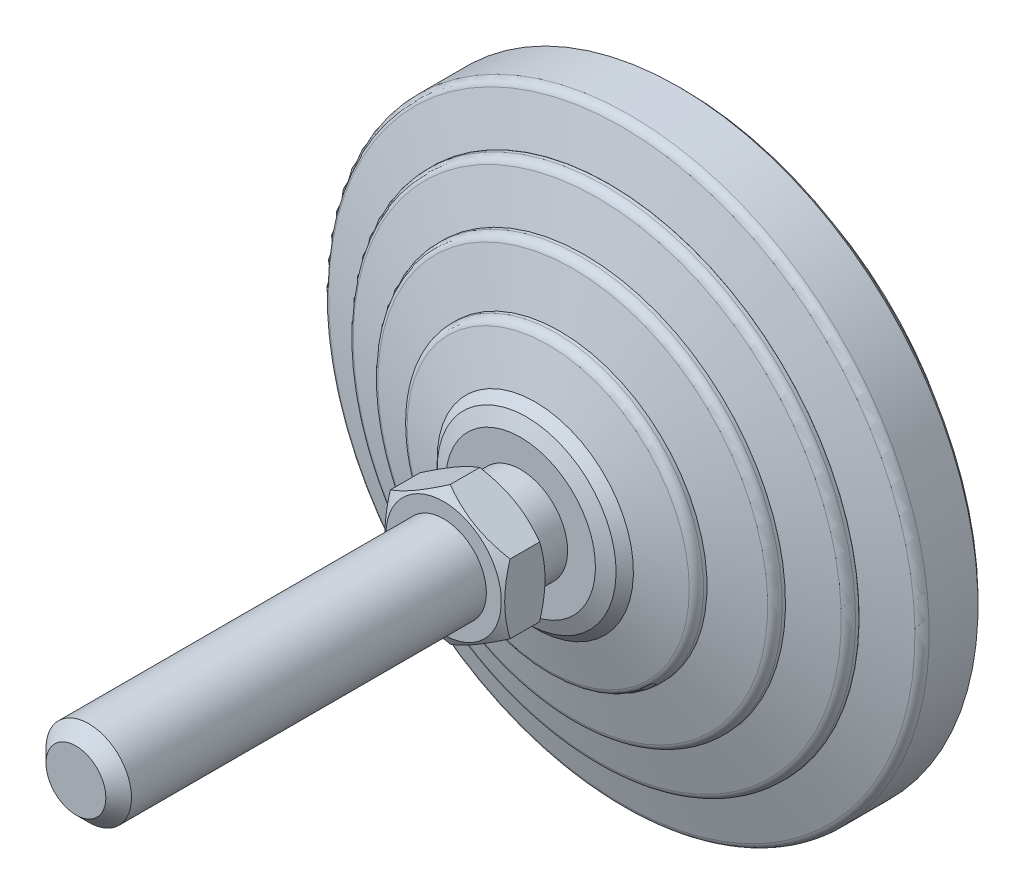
ISO-10303-21;
HEADER;
FILE_DESCRIPTION(('STEP AP214'),'2;1');
FILE_NAME('part.step','',(''),(''),'','','');
FILE_SCHEMA(('AUTOMOTIVE_DESIGN { 1 0 10303 214 1 1 1 1 }'));
ENDSEC;
DATA;
#1=APPLICATION_CONTEXT('core data for automotive mechanical design processes');
#2=APPLICATION_PROTOCOL_DEFINITION('international standard','automotive_design',2000,#1);
#3=PRODUCT_CONTEXT('',#1,'mechanical');
#4=PRODUCT('Part','Part','',(#3));
#5=PRODUCT_RELATED_PRODUCT_CATEGORY('part','',(#4));
#6=PRODUCT_DEFINITION_FORMATION('','',#4);
#7=PRODUCT_DEFINITION_CONTEXT('part definition',#1,'design');
#8=PRODUCT_DEFINITION('design','',#6,#7);
#9=PRODUCT_DEFINITION_SHAPE('','',#8);
#10=(LENGTH_UNIT() NAMED_UNIT(*) SI_UNIT(.MILLI.,.METRE.));
#11=(NAMED_UNIT(*) PLANE_ANGLE_UNIT() SI_UNIT($,.RADIAN.));
#12=(NAMED_UNIT(*) SI_UNIT($,.STERADIAN.) SOLID_ANGLE_UNIT());
#13=UNCERTAINTY_MEASURE_WITH_UNIT(LENGTH_MEASURE(1.E-05),#10,'distance_accuracy_value','');
#14=(GEOMETRIC_REPRESENTATION_CONTEXT(3) GLOBAL_UNCERTAINTY_ASSIGNED_CONTEXT((#13)) GLOBAL_UNIT_ASSIGNED_CONTEXT((#10,
#11,#12)) REPRESENTATION_CONTEXT('',''));
#15=CARTESIAN_POINT('',(0.,0.,0.));
#16=DIRECTION('',(0.,0.,1.));
#17=DIRECTION('',(1.,0.,0.));
#18=AXIS2_PLACEMENT_3D('',#15,#16,#17);
#19=CARTESIAN_POINT('',(-5.5,0.,26.));
#20=DIRECTION('',(0.,0.,1.));
#21=DIRECTION('',(0.,-1.,0.));
#22=AXIS2_PLACEMENT_3D('',#19,#20,#21);
#23=PLANE('',#22);
#24=CARTESIAN_POINT('',(0.,0.,26.));
#25=DIRECTION('',(0.,0.,-1.));
#26=DIRECTION('',(-1.,0.,0.));
#27=AXIS2_PLACEMENT_3D('',#24,#25,#26);
#28=CIRCLE('',#27,6.75);
#29=CARTESIAN_POINT('',(-6.75,0.,26.));
#30=VERTEX_POINT('',#29);
#31=EDGE_CURVE('E596',#30,#30,#28,.T.);
#32=ORIENTED_EDGE('',*,*,#31,.T.);
#33=EDGE_LOOP('',(#32));
#34=FACE_BOUND('',#33,.T.);
#35=CARTESIAN_POINT('',(0.,0.,26.));
#36=DIRECTION('',(0.,0.,-1.));
#37=DIRECTION('',(0.,1.,0.));
#38=AXIS2_PLACEMENT_3D('',#35,#36,#37);
#39=CIRCLE('',#38,5.5);
#40=CARTESIAN_POINT('',(0.,5.5,26.));
#41=VERTEX_POINT('',#40);
#42=EDGE_CURVE('E156',#41,#41,#39,.T.);
#43=ORIENTED_EDGE('',*,*,#42,.F.);
#44=EDGE_LOOP('',(#43));
#45=FACE_BOUND('',#44,.T.);
#46=ADVANCED_FACE('F14',(#34,#45),#23,.F.);
#47=CARTESIAN_POINT('',(0.,0.,0.));
#48=DIRECTION('',(0.,0.,-1.));
#49=DIRECTION('',(0.,1.,0.));
#50=AXIS2_PLACEMENT_3D('',#47,#48,#49);
#51=CYLINDRICAL_SURFACE('',#50,5.5);
#52=CARTESIAN_POINT('',(0.,0.,22.));
#53=DIRECTION('',(0.,0.,-1.));
#54=DIRECTION('',(0.,1.,0.));
#55=AXIS2_PLACEMENT_3D('',#52,#53,#54);
#56=CIRCLE('',#55,5.5);
#57=CARTESIAN_POINT('',(0.,5.5,22.));
#58=VERTEX_POINT('',#57);
#59=EDGE_CURVE('E153',#58,#58,#56,.T.);
#60=ORIENTED_EDGE('',*,*,#59,.F.);
#61=EDGE_LOOP('',(#60));
#62=FACE_BOUND('',#61,.T.);
#63=ORIENTED_EDGE('',*,*,#42,.T.);
#64=EDGE_LOOP('',(#63));
#65=FACE_BOUND('',#64,.T.);
#66=ADVANCED_FACE('F179',(#62,#65),#51,.T.);
#67=CARTESIAN_POINT('',(-8.75409836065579,0.,22.));
#68=DIRECTION('',(0.,0.,-1.));
#69=DIRECTION('',(0.,1.,0.));
#70=AXIS2_PLACEMENT_3D('',#67,#68,#69);
#71=PLANE('',#70);
#72=CARTESIAN_POINT('',(0.,0.,22.));
#73=DIRECTION('',(0.,0.,-1.));
#74=DIRECTION('',(0.,1.,0.));
#75=AXIS2_PLACEMENT_3D('',#72,#73,#74);
#76=CIRCLE('',#75,8.75409836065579);
#77=CARTESIAN_POINT('',(0.,8.75409836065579,22.));
#78=VERTEX_POINT('',#77);
#79=EDGE_CURVE('E150',#78,#78,#76,.T.);
#80=ORIENTED_EDGE('',*,*,#79,.F.);
#81=EDGE_LOOP('',(#80));
#82=FACE_BOUND('',#81,.T.);
#83=ORIENTED_EDGE('',*,*,#59,.T.);
#84=EDGE_LOOP('',(#83));
#85=FACE_BOUND('',#84,.T.);
#86=ADVANCED_FACE('F185',(#82,#85),#71,.F.);
#87=CARTESIAN_POINT('',(0.,0.,22.));
#88=DIRECTION('',(0.,0.,-1.));
#89=DIRECTION('',(0.,1.,0.));
#90=AXIS2_PLACEMENT_3D('',#87,#88,#89);
#91=CONICAL_SURFACE('',#90,8.75409836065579,1.17809724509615);
#92=CARTESIAN_POINT('',(0.,0.,21.2928932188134));
#93=DIRECTION('',(0.,0.,-1.));
#94=DIRECTION('',(0.,1.,0.));
#95=AXIS2_PLACEMENT_3D('',#92,#93,#94);
#96=CIRCLE('',#95,10.4612051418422);
#97=CARTESIAN_POINT('',(0.,10.4612051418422,21.2928932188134));
#98=VERTEX_POINT('',#97);
#99=EDGE_CURVE('E147',#98,#98,#96,.T.);
#100=ORIENTED_EDGE('',*,*,#99,.F.);
#101=EDGE_LOOP('',(#100));
#102=FACE_BOUND('',#101,.T.);
#103=ORIENTED_EDGE('',*,*,#79,.T.);
#104=EDGE_LOOP('',(#103));
#105=FACE_BOUND('',#104,.T.);
#106=ADVANCED_FACE('F440',(#102,#105),#91,.T.);
#107=CARTESIAN_POINT('',(0.,0.,21.2928932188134));
#108=DIRECTION('',(0.,0.,-1.));
#109=DIRECTION('',(0.,1.,0.));
#110=AXIS2_PLACEMENT_3D('',#107,#108,#109);
#111=CONICAL_SURFACE('',#110,10.4612051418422,0.785398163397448);
#112=CARTESIAN_POINT('',(0.,0.,20.2786885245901));
#113=DIRECTION('',(0.,0.,-1.));
#114=DIRECTION('',(0.,1.,0.));
#115=AXIS2_PLACEMENT_3D('',#112,#113,#114);
#116=CIRCLE('',#115,11.4754098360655);
#117=CARTESIAN_POINT('',(0.,11.4754098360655,20.2786885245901));
#118=VERTEX_POINT('',#117);
#119=EDGE_CURVE('E144',#118,#118,#116,.T.);
#120=ORIENTED_EDGE('',*,*,#119,.F.);
#121=EDGE_LOOP('',(#120));
#122=FACE_BOUND('',#121,.T.);
#123=ORIENTED_EDGE('',*,*,#99,.T.);
#124=EDGE_LOOP('',(#123));
#125=FACE_BOUND('',#124,.T.);
#126=ADVANCED_FACE('F431',(#122,#125),#111,.T.);
#127=CARTESIAN_POINT('',(0.,0.,20.2786885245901));
#128=DIRECTION('',(0.,0.,-1.));
#129=DIRECTION('',(0.,1.,0.));
#130=AXIS2_PLACEMENT_3D('',#127,#128,#129);
#131=CONICAL_SURFACE('',#130,11.4754098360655,1.27933953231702);
#132=CARTESIAN_POINT('',(0.,0.,18.7711726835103));
#133=DIRECTION('',(0.,0.,-1.));
#134=DIRECTION('',(0.,1.,0.));
#135=AXIS2_PLACEMENT_3D('',#132,#133,#134);
#136=CIRCLE('',#135,16.5004626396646);
#137=CARTESIAN_POINT('',(0.,16.5004626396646,18.7711726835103));
#138=VERTEX_POINT('',#137);
#139=EDGE_CURVE('E141',#138,#138,#136,.T.);
#140=ORIENTED_EDGE('',*,*,#139,.F.);
#141=EDGE_LOOP('',(#140));
#142=FACE_BOUND('',#141,.T.);
#143=ORIENTED_EDGE('',*,*,#119,.T.);
#144=EDGE_LOOP('',(#143));
#145=FACE_BOUND('',#144,.T.);
#146=ADVANCED_FACE('F422',(#142,#145),#131,.T.);
#147=CARTESIAN_POINT('',(0.,0.,17.8133463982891));
#148=DIRECTION('',(0.,0.,-1.));
#149=DIRECTION('',(0.,1.,0.));
#150=AXIS2_PLACEMENT_3D('',#147,#148,#149);
#151=TOROIDAL_SURFACE('',#150,16.2131147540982,1.);
#152=CARTESIAN_POINT('',(0.,0.,17.8133463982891));
#153=DIRECTION('',(0.,0.,-1.));
#154=DIRECTION('',(0.,1.,0.));
#155=AXIS2_PLACEMENT_3D('',#152,#153,#154);
#156=CIRCLE('',#155,17.2131147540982);
#157=CARTESIAN_POINT('',(0.,17.2131147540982,17.8133463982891));
#158=VERTEX_POINT('',#157);
#159=EDGE_CURVE('E138',#158,#158,#156,.T.);
#160=ORIENTED_EDGE('',*,*,#159,.F.);
#161=EDGE_LOOP('',(#160));
#162=FACE_BOUND('',#161,.T.);
#163=ORIENTED_EDGE('',*,*,#139,.T.);
#164=EDGE_LOOP('',(#163));
#165=FACE_BOUND('',#164,.T.);
#166=ADVANCED_FACE('F413',(#162,#165),#151,.T.);
#167=CARTESIAN_POINT('',(0.,0.,0.));
#168=DIRECTION('',(0.,0.,-1.));
#169=DIRECTION('',(0.,1.,0.));
#170=AXIS2_PLACEMENT_3D('',#167,#168,#169);
#171=CYLINDRICAL_SURFACE('',#170,17.2131147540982);
#172=CARTESIAN_POINT('',(0.,0.,17.4098360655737));
#173=DIRECTION('',(0.,0.,-1.));
#174=DIRECTION('',(0.,1.,0.));
#175=AXIS2_PLACEMENT_3D('',#172,#173,#174);
#176=CIRCLE('',#175,17.2131147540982);
#177=CARTESIAN_POINT('',(0.,17.2131147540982,17.4098360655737));
#178=VERTEX_POINT('',#177);
#179=EDGE_CURVE('E135',#178,#178,#176,.T.);
#180=ORIENTED_EDGE('',*,*,#179,.F.);
#181=EDGE_LOOP('',(#180));
#182=FACE_BOUND('',#181,.T.);
#183=ORIENTED_EDGE('',*,*,#159,.T.);
#184=EDGE_LOOP('',(#183));
#185=FACE_BOUND('',#184,.T.);
#186=ADVANCED_FACE('F404',(#182,#185),#171,.T.);
#187=CARTESIAN_POINT('',(0.,0.,17.4098360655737));
#188=DIRECTION('',(0.,0.,-1.));
#189=DIRECTION('',(0.,1.,0.));
#190=AXIS2_PLACEMENT_3D('',#187,#188,#189);
#191=CONICAL_SURFACE('',#190,17.2131147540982,1.30454427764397);
#192=CARTESIAN_POINT('',(0.,0.,15.8894925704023));
#193=DIRECTION('',(0.,0.,-1.));
#194=DIRECTION('',(0.,1.,0.));
#195=AXIS2_PLACEMENT_3D('',#192,#193,#194);
#196=CIRCLE('',#195,22.7877075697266);
#197=CARTESIAN_POINT('',(0.,22.7877075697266,15.8894925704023));
#198=VERTEX_POINT('',#197);
#199=EDGE_CURVE('E132',#198,#198,#196,.T.);
#200=ORIENTED_EDGE('',*,*,#199,.F.);
#201=EDGE_LOOP('',(#200));
#202=FACE_BOUND('',#201,.T.);
#203=ORIENTED_EDGE('',*,*,#179,.T.);
#204=EDGE_LOOP('',(#203));
#205=FACE_BOUND('',#204,.T.);
#206=ADVANCED_FACE('F395',(#202,#205),#191,.T.);
#207=CARTESIAN_POINT('',(0.,0.,14.9247287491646));
#208=DIRECTION('',(0.,0.,-1.));
#209=DIRECTION('',(0.,1.,0.));
#210=AXIS2_PLACEMENT_3D('',#207,#208,#209);
#211=TOROIDAL_SURFACE('',#210,22.5245901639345,1.);
#212=CARTESIAN_POINT('',(0.,0.,14.9247287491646));
#213=DIRECTION('',(0.,0.,-1.));
#214=DIRECTION('',(0.,1.,0.));
#215=AXIS2_PLACEMENT_3D('',#212,#213,#214);
#216=CIRCLE('',#215,23.5245901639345);
#217=CARTESIAN_POINT('',(0.,23.5245901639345,14.9247287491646));
#218=VERTEX_POINT('',#217);
#219=EDGE_CURVE('E129',#218,#218,#216,.T.);
#220=ORIENTED_EDGE('',*,*,#219,.F.);
#221=EDGE_LOOP('',(#220));
#222=FACE_BOUND('',#221,.T.);
#223=ORIENTED_EDGE('',*,*,#199,.T.);
#224=EDGE_LOOP('',(#223));
#225=FACE_BOUND('',#224,.T.);
#226=ADVANCED_FACE('F386',(#222,#225),#211,.T.);
#227=CARTESIAN_POINT('',(0.,0.,0.));
#228=DIRECTION('',(0.,0.,-1.));
#229=DIRECTION('',(0.,1.,0.));
#230=AXIS2_PLACEMENT_3D('',#227,#228,#229);
#231=CYLINDRICAL_SURFACE('',#230,23.5245901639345);
#232=CARTESIAN_POINT('',(0.,0.,14.5409836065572));
#233=DIRECTION('',(0.,0.,-1.));
#234=DIRECTION('',(0.,1.,0.));
#235=AXIS2_PLACEMENT_3D('',#232,#233,#234);
#236=CIRCLE('',#235,23.5245901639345);
#237=CARTESIAN_POINT('',(0.,23.5245901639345,14.5409836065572));
#238=VERTEX_POINT('',#237);
#239=EDGE_CURVE('E126',#238,#238,#236,.T.);
#240=ORIENTED_EDGE('',*,*,#239,.F.);
#241=EDGE_LOOP('',(#240));
#242=FACE_BOUND('',#241,.T.);
#243=ORIENTED_EDGE('',*,*,#219,.T.);
#244=EDGE_LOOP('',(#243));
#245=FACE_BOUND('',#244,.T.);
#246=ADVANCED_FACE('F377',(#242,#245),#231,.T.);
#247=CARTESIAN_POINT('',(0.,0.,14.5409836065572));
#248=DIRECTION('',(0.,0.,-1.));
#249=DIRECTION('',(0.,1.,0.));
#250=AXIS2_PLACEMENT_3D('',#247,#248,#249);
#251=CONICAL_SURFACE('',#250,23.5245901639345,1.2787125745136);
#252=CARTESIAN_POINT('',(0.,0.,13.0337743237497));
#253=DIRECTION('',(0.,0.,-1.));
#254=DIRECTION('',(0.,1.,0.));
#255=AXIS2_PLACEMENT_3D('',#252,#253,#254);
#256=CIRCLE('',#255,28.5372004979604);
#257=CARTESIAN_POINT('',(0.,28.5372004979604,13.0337743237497));
#258=VERTEX_POINT('',#257);
#259=EDGE_CURVE('E123',#258,#258,#256,.T.);
#260=ORIENTED_EDGE('',*,*,#259,.F.);
#261=EDGE_LOOP('',(#260));
#262=FACE_BOUND('',#261,.T.);
#263=ORIENTED_EDGE('',*,*,#239,.T.);
#264=EDGE_LOOP('',(#263));
#265=FACE_BOUND('',#264,.T.);
#266=ADVANCED_FACE('F368',(#262,#265),#251,.T.);
#267=CARTESIAN_POINT('',(0.,0.,12.0761283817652));
#268=DIRECTION('',(0.,0.,-1.));
#269=DIRECTION('',(0.,1.,0.));
#270=AXIS2_PLACEMENT_3D('',#267,#268,#269);
#271=TOROIDAL_SURFACE('',#270,28.2492521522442,1.);
#272=CARTESIAN_POINT('',(0.,0.,12.0761283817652));
#273=DIRECTION('',(0.,0.,-1.));
#274=DIRECTION('',(0.,1.,0.));
#275=AXIS2_PLACEMENT_3D('',#272,#273,#274);
#276=CIRCLE('',#275,29.2492521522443);
#277=CARTESIAN_POINT('',(0.,29.2492521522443,12.0761283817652));
#278=VERTEX_POINT('',#277);
#279=EDGE_CURVE('E120',#278,#278,#276,.T.);
#280=ORIENTED_EDGE('',*,*,#279,.F.);
#281=EDGE_LOOP('',(#280));
#282=FACE_BOUND('',#281,.T.);
#283=ORIENTED_EDGE('',*,*,#259,.T.);
#284=EDGE_LOOP('',(#283));
#285=FACE_BOUND('',#284,.T.);
#286=ADVANCED_FACE('F359',(#282,#285),#271,.T.);
#287=CARTESIAN_POINT('',(0.,0.,0.));
#288=DIRECTION('',(0.,0.,-1.));
#289=DIRECTION('',(0.,1.,0.));
#290=AXIS2_PLACEMENT_3D('',#287,#288,#289);
#291=CYLINDRICAL_SURFACE('',#290,29.2492521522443);
#292=CARTESIAN_POINT('',(0.,0.,11.6721311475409));
#293=DIRECTION('',(0.,0.,-1.));
#294=DIRECTION('',(0.,1.,0.));
#295=AXIS2_PLACEMENT_3D('',#292,#293,#294);
#296=CIRCLE('',#295,29.2492521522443);
#297=CARTESIAN_POINT('',(0.,29.2492521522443,11.6721311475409));
#298=VERTEX_POINT('',#297);
#299=EDGE_CURVE('E117',#298,#298,#296,.T.);
#300=ORIENTED_EDGE('',*,*,#299,.F.);
#301=EDGE_LOOP('',(#300));
#302=FACE_BOUND('',#301,.T.);
#303=ORIENTED_EDGE('',*,*,#279,.T.);
#304=EDGE_LOOP('',(#303));
#305=FACE_BOUND('',#304,.T.);
#306=ADVANCED_FACE('F350',(#302,#305),#291,.T.);
#307=CARTESIAN_POINT('',(-29.2622950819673,0.,11.6721311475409));
#308=DIRECTION('',(0.,0.,-1.));
#309=DIRECTION('',(0.,1.,0.));
#310=AXIS2_PLACEMENT_3D('',#307,#308,#309);
#311=PLANE('',#310);
#312=CARTESIAN_POINT('',(0.,0.,11.6721311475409));
#313=DIRECTION('',(0.,0.,-1.));
#314=DIRECTION('',(0.,1.,0.));
#315=AXIS2_PLACEMENT_3D('',#312,#313,#314);
#316=CIRCLE('',#315,29.2622950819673);
#317=CARTESIAN_POINT('',(0.,29.2622950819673,11.6721311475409));
#318=VERTEX_POINT('',#317);
#319=EDGE_CURVE('E114',#318,#318,#316,.T.);
#320=ORIENTED_EDGE('',*,*,#319,.F.);
#321=EDGE_LOOP('',(#320));
#322=FACE_BOUND('',#321,.T.);
#323=ORIENTED_EDGE('',*,*,#299,.T.);
#324=EDGE_LOOP('',(#323));
#325=FACE_BOUND('',#324,.T.);
#326=ADVANCED_FACE('F341',(#322,#325),#311,.F.);
#327=CARTESIAN_POINT('',(0.,0.,11.6721311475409));
#328=DIRECTION('',(0.,0.,-1.));
#329=DIRECTION('',(0.,1.,0.));
#330=AXIS2_PLACEMENT_3D('',#327,#328,#329);
#331=CONICAL_SURFACE('',#330,29.2622950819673,1.27933953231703);
#332=CARTESIAN_POINT('',(0.,0.,10.1646153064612));
#333=DIRECTION('',(0.,0.,-1.));
#334=DIRECTION('',(0.,1.,0.));
#335=AXIS2_PLACEMENT_3D('',#332,#333,#334);
#336=CIRCLE('',#335,34.2873478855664);
#337=CARTESIAN_POINT('',(0.,34.2873478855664,10.1646153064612));
#338=VERTEX_POINT('',#337);
#339=EDGE_CURVE('E111',#338,#338,#336,.T.);
#340=ORIENTED_EDGE('',*,*,#339,.F.);
#341=EDGE_LOOP('',(#340));
#342=FACE_BOUND('',#341,.T.);
#343=ORIENTED_EDGE('',*,*,#319,.T.);
#344=EDGE_LOOP('',(#343));
#345=FACE_BOUND('',#344,.T.);
#346=ADVANCED_FACE('F332',(#342,#345),#331,.T.);
#347=CARTESIAN_POINT('',(0.,0.,9.20678902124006));
#348=DIRECTION('',(0.,0.,-1.));
#349=DIRECTION('',(0.,1.,0.));
#350=AXIS2_PLACEMENT_3D('',#347,#348,#349);
#351=TOROIDAL_SURFACE('',#350,34.,1.);
#352=CARTESIAN_POINT('',(0.,0.,9.20678902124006));
#353=DIRECTION('',(0.,0.,-1.));
#354=DIRECTION('',(0.,1.,0.));
#355=AXIS2_PLACEMENT_3D('',#352,#353,#354);
#356=CIRCLE('',#355,35.);
#357=CARTESIAN_POINT('',(0.,35.,9.20678902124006));
#358=VERTEX_POINT('',#357);
#359=EDGE_CURVE('E108',#358,#358,#356,.T.);
#360=ORIENTED_EDGE('',*,*,#359,.F.);
#361=EDGE_LOOP('',(#360));
#362=FACE_BOUND('',#361,.T.);
#363=ORIENTED_EDGE('',*,*,#339,.T.);
#364=EDGE_LOOP('',(#363));
#365=FACE_BOUND('',#364,.T.);
#366=ADVANCED_FACE('F323',(#362,#365),#351,.T.);
#367=CARTESIAN_POINT('',(0.,0.,0.));
#368=DIRECTION('',(0.,0.,-1.));
#369=DIRECTION('',(0.,1.,0.));
#370=AXIS2_PLACEMENT_3D('',#367,#368,#369);
#371=CYLINDRICAL_SURFACE('',#370,35.);
#372=CARTESIAN_POINT('',(0.,0.,3.5));
#373=DIRECTION('',(0.,0.,-1.));
#374=DIRECTION('',(0.,1.,0.));
#375=AXIS2_PLACEMENT_3D('',#372,#373,#374);
#376=CIRCLE('',#375,35.);
#377=CARTESIAN_POINT('',(0.,35.,3.5));
#378=VERTEX_POINT('',#377);
#379=EDGE_CURVE('E105',#378,#378,#376,.T.);
#380=ORIENTED_EDGE('',*,*,#379,.F.);
#381=EDGE_LOOP('',(#380));
#382=FACE_BOUND('',#381,.T.);
#383=ORIENTED_EDGE('',*,*,#359,.T.);
#384=EDGE_LOOP('',(#383));
#385=FACE_BOUND('',#384,.T.);
#386=ADVANCED_FACE('F314',(#382,#385),#371,.T.);
#387=CARTESIAN_POINT('',(0.,0.,3.5));
#388=DIRECTION('',(0.,0.,1.));
#389=DIRECTION('',(0.,-1.,0.));
#390=AXIS2_PLACEMENT_3D('',#387,#388,#389);
#391=CONICAL_SURFACE('',#390,35.,0.785398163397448);
#392=CARTESIAN_POINT('',(0.,0.,3.));
#393=DIRECTION('',(0.,0.,-1.));
#394=DIRECTION('',(0.,1.,0.));
#395=AXIS2_PLACEMENT_3D('',#392,#393,#394);
#396=CIRCLE('',#395,34.5);
#397=CARTESIAN_POINT('',(0.,34.5,3.));
#398=VERTEX_POINT('',#397);
#399=EDGE_CURVE('E102',#398,#398,#396,.T.);
#400=ORIENTED_EDGE('',*,*,#399,.F.);
#401=EDGE_LOOP('',(#400));
#402=FACE_BOUND('',#401,.T.);
#403=ORIENTED_EDGE('',*,*,#379,.T.);
#404=EDGE_LOOP('',(#403));
#405=FACE_BOUND('',#404,.T.);
#406=ADVANCED_FACE('F305',(#402,#405),#391,.T.);
#407=CARTESIAN_POINT('',(-34.5,0.,3.));
#408=DIRECTION('',(0.,0.,1.));
#409=DIRECTION('',(0.,-1.,0.));
#410=AXIS2_PLACEMENT_3D('',#407,#408,#409);
#411=PLANE('',#410);
#412=CARTESIAN_POINT('',(0.,0.,3.));
#413=DIRECTION('',(0.,0.,-1.));
#414=DIRECTION('',(0.,1.,0.));
#415=AXIS2_PLACEMENT_3D('',#412,#413,#414);
#416=CIRCLE('',#415,30.4098360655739);
#417=CARTESIAN_POINT('',(0.,30.4098360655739,3.));
#418=VERTEX_POINT('',#417);
#419=EDGE_CURVE('E99',#418,#418,#416,.T.);
#420=ORIENTED_EDGE('',*,*,#419,.F.);
#421=EDGE_LOOP('',(#420));
#422=FACE_BOUND('',#421,.T.);
#423=ORIENTED_EDGE('',*,*,#399,.T.);
#424=EDGE_LOOP('',(#423));
#425=FACE_BOUND('',#424,.T.);
#426=ADVANCED_FACE('F296',(#422,#425),#411,.F.);
#427=CARTESIAN_POINT('',(0.,0.,0.));
#428=DIRECTION('',(0.,0.,-1.));
#429=DIRECTION('',(0.,1.,0.));
#430=AXIS2_PLACEMENT_3D('',#427,#428,#429);
#431=CYLINDRICAL_SURFACE('',#430,30.4098360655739);
#432=CARTESIAN_POINT('',(0.,0.,0.));
#433=DIRECTION('',(0.,0.,-1.));
#434=DIRECTION('',(0.,1.,0.));
#435=AXIS2_PLACEMENT_3D('',#432,#433,#434);
#436=CIRCLE('',#435,30.4098360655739);
#437=CARTESIAN_POINT('',(0.,30.4098360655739,0.));
#438=VERTEX_POINT('',#437);
#439=EDGE_CURVE('E96',#438,#438,#436,.T.);
#440=ORIENTED_EDGE('',*,*,#439,.F.);
#441=EDGE_LOOP('',(#440));
#442=FACE_BOUND('',#441,.T.);
#443=ORIENTED_EDGE('',*,*,#419,.T.);
#444=EDGE_LOOP('',(#443));
#445=FACE_BOUND('',#444,.T.);
#446=ADVANCED_FACE('F286',(#442,#445),#431,.T.);
#447=CARTESIAN_POINT('',(-30.4098360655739,0.,0.));
#448=DIRECTION('',(0.,0.,1.));
#449=DIRECTION('',(0.,-1.,0.));
#450=AXIS2_PLACEMENT_3D('',#447,#448,#449);
#451=PLANE('',#450);
#452=ORIENTED_EDGE('',*,*,#439,.T.);
#453=EDGE_LOOP('',(#452));
#454=FACE_BOUND('',#453,.T.);
#455=ADVANCED_FACE('F177',(#454),#451,.F.);
#456=CARTESIAN_POINT('',(0.,0.,27.2271018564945));
#457=DIRECTION('',(0.,0.,1.));
#458=DIRECTION('',(1.,0.,0.));
#459=AXIS2_PLACEMENT_3D('',#456,#457,#458);
#460=CONICAL_SURFACE('',#459,8.87540276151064,1.0471975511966);
#461=CARTESIAN_POINT('',(0.259539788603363,-8.23274913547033,26.8584269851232));
#462=CARTESIAN_POINT('',(-0.0671565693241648,-8.0441309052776,26.7436265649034));
#463=CARTESIAN_POINT('',(-0.396907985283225,-7.85374883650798,26.6385459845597));
#464=CARTESIAN_POINT('',(-1.06279446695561,-7.4692990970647,26.4540420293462));
#465=CARTESIAN_POINT('',(-1.39894643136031,-7.27522166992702,26.3747008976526));
#466=CARTESIAN_POINT('',(-1.90175718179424,-6.98492374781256,26.2811054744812));
#467=CARTESIAN_POINT('',(-2.06666621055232,-6.88971347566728,26.2543637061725));
#468=CARTESIAN_POINT('',(-2.39734880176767,-6.69879379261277,26.2092314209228));
#469=CARTESIAN_POINT('',(-2.56312237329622,-6.60308437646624,26.190840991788));
#470=CARTESIAN_POINT('',(-2.89496407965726,-6.41149547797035,26.1629361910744));
#471=CARTESIAN_POINT('',(-3.06103130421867,-6.31561652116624,26.1534075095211));
#472=CARTESIAN_POINT('',(-3.39337132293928,-6.12373992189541,26.1434474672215));
#473=CARTESIAN_POINT('',(-3.55964411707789,-6.02774227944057,26.1430161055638));
#474=CARTESIAN_POINT('',(-3.90231745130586,-5.82989973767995,26.1515212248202));
#475=CARTESIAN_POINT('',(-4.07870725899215,-5.72806103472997,26.1610397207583));
#476=CARTESIAN_POINT('',(-4.43086955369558,-5.52474003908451,26.1900458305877));
#477=CARTESIAN_POINT('',(-4.60664202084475,-5.42325775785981,26.2095337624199));
#478=CARTESIAN_POINT('',(-4.95753804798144,-5.22066784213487,26.2579301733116));
#479=CARTESIAN_POINT('',(-5.13265976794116,-5.11956126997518,26.2868562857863));
#480=CARTESIAN_POINT('',(-5.48167498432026,-4.91805724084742,26.3533264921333));
#481=CARTESIAN_POINT('',(-5.65556838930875,-4.81765983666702,26.3908712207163));
#482=CARTESIAN_POINT('',(-6.00749082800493,-4.61447732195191,26.4750026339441));
#483=CARTESIAN_POINT('',(-6.18547467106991,-4.51171830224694,26.5218397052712));
#484=CARTESIAN_POINT('',(-6.5399104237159,-4.30708472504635,26.6227368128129));
#485=CARTESIAN_POINT('',(-6.71636216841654,-4.20521026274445,26.6767976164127));
#486=CARTESIAN_POINT('',(-7.06700085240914,-4.00276892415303,26.7909393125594));
#487=CARTESIAN_POINT('',(-7.2411941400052,-3.90219838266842,26.8509943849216));
#488=CARTESIAN_POINT('',(-7.58806267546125,-3.70193374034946,26.9764484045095));
#489=CARTESIAN_POINT('',(-7.76073847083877,-3.60223932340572,27.0418453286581));
#490=CARTESIAN_POINT('',(-7.9327249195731,-3.50294290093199,27.1095057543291));
#491=B_SPLINE_CURVE_WITH_KNOTS('',3,(#461,#462,#463,#464,#465,#466,#467,#468,#469,#470,#471,
#472,#473,#474,#475,#476,#477,#478,#479,#480,#481,#482,#483,#484,#485,#486,#487,#488,#489,#490),
.UNSPECIFIED.,.F.,.F.,(4,2,2,2,2,2,2,2,2,2,2,2,2,2,4),(0.,1.18369823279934,2.37114221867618,
2.94784068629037,3.52454521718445,4.10031685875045,4.67608844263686,5.28753040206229,
5.89899186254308,6.51160232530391,7.12425791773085,7.75647143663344,8.38875216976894,
9.01841815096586,9.64784675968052),.UNSPECIFIED.);
#492=CARTESIAN_POINT('',(0.,-8.08290376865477,26.7695523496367));
#493=VERTEX_POINT('',#492);
#494=CARTESIAN_POINT('',(-7.,-4.04145188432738,26.7695523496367));
#495=VERTEX_POINT('',#494);
#496=EDGE_CURVE('E73',#493,#495,#491,.T.);
#497=ORIENTED_EDGE('',*,*,#496,.T.);
#498=CARTESIAN_POINT('',(-7.,-10.7620300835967,29.5150669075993));
#499=CARTESIAN_POINT('',(-7.,-10.4570652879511,29.3675113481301));
#500=CARTESIAN_POINT('',(-7.,-10.1513902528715,29.2213980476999));
#501=CARTESIAN_POINT('',(-7.,-9.53824161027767,28.9328690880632));
#502=CARTESIAN_POINT('',(-7.,-9.2307677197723,28.790454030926));
#503=CARTESIAN_POINT('',(-7.,-8.61201357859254,28.5093979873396));
#504=CARTESIAN_POINT('',(-7.,-8.30072165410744,28.3707826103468));
#505=CARTESIAN_POINT('',(-7.,-7.67562881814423,28.0993514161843));
#506=CARTESIAN_POINT('',(-7.,-7.36182802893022,27.9665353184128));
#507=CARTESIAN_POINT('',(-7.,-6.721463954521,27.7042417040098));
#508=CARTESIAN_POINT('',(-7.,-6.39480593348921,27.5749941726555));
#509=CARTESIAN_POINT('',(-7.,-5.73763452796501,27.326510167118));
#510=CARTESIAN_POINT('',(-7.,-5.40712071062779,27.2072748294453));
#511=CARTESIAN_POINT('',(-7.,-4.74235745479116,26.9820147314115));
#512=CARTESIAN_POINT('',(-7.,-4.4081174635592,26.8759623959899));
#513=CARTESIAN_POINT('',(-7.,-3.73485675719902,26.6805313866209));
#514=CARTESIAN_POINT('',(-7.,-3.39583761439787,26.591147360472));
#515=CARTESIAN_POINT('',(-7.,-2.71462929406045,26.4338794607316));
#516=CARTESIAN_POINT('',(-7.,-2.37246689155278,26.3658827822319));
#517=CARTESIAN_POINT('',(-7.,-1.85618394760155,26.2829190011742));
#518=CARTESIAN_POINT('',(-7.,-1.68356966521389,26.2584351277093));
#519=CARTESIAN_POINT('',(-7.,-1.33751541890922,26.2162933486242));
#520=CARTESIAN_POINT('',(-7.,-1.1640755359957,26.1986347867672));
#521=CARTESIAN_POINT('',(-7.,-0.818826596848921,26.1707121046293));
#522=CARTESIAN_POINT('',(-7.,-0.647024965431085,26.1603565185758));
#523=CARTESIAN_POINT('',(-7.,-0.303138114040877,26.1469128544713));
#524=CARTESIAN_POINT('',(-7.,-0.13105289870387,26.1438246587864));
#525=CARTESIAN_POINT('',(-7.,0.213094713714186,26.1449892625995));
#526=CARTESIAN_POINT('',(-7.,0.385157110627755,26.1492421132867));
#527=CARTESIAN_POINT('',(-7.,0.728952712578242,26.1649865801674));
#528=CARTESIAN_POINT('',(-7.,0.900685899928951,26.1764785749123));
#529=CARTESIAN_POINT('',(-7.,1.31629942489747,26.2128105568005));
#530=CARTESIAN_POINT('',(-7.,1.5598718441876,26.2412453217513));
#531=CARTESIAN_POINT('',(-7.,2.04513516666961,26.3111036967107));
#532=CARTESIAN_POINT('',(-7.,2.2868257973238,26.3525291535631));
#533=CARTESIAN_POINT('',(-7.,3.00884015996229,26.4940885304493));
#534=CARTESIAN_POINT('',(-7.,3.48582151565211,26.6114773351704));
#535=CARTESIAN_POINT('',(-7.,4.1989166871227,26.8141071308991));
#536=CARTESIAN_POINT('',(-7.,4.43875222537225,26.8869959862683));
#537=CARTESIAN_POINT('',(-7.,4.91609245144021,27.0401113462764));
#538=CARTESIAN_POINT('',(-7.,5.15359712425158,27.1203378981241));
#539=CARTESIAN_POINT('',(-7.,5.62635489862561,27.2868609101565));
#540=CARTESIAN_POINT('',(-7.,5.86160876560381,27.3731552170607));
#541=CARTESIAN_POINT('',(-7.,6.33018316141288,27.5508216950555));
#542=CARTESIAN_POINT('',(-7.,6.56350370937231,27.6421938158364));
#543=CARTESIAN_POINT('',(-7.,7.09913920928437,27.8576056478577));
#544=CARTESIAN_POINT('',(-7.,7.40085625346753,27.9831290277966));
#545=CARTESIAN_POINT('',(-7.,8.00185149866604,28.2398994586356));
#546=CARTESIAN_POINT('',(-7.,8.30112957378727,28.3711468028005));
#547=CARTESIAN_POINT('',(-7.,8.89768244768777,28.6382586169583));
#548=CARTESIAN_POINT('',(-7.,9.1949568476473,28.7741239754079));
#549=CARTESIAN_POINT('',(-7.,9.787767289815,29.0495744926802));
#550=CARTESIAN_POINT('',(-7.,10.0833033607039,29.1891595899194));
#551=CARTESIAN_POINT('',(-7.,10.6731846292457,29.4715047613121));
#552=CARTESIAN_POINT('',(-7.,10.9675284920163,29.6142676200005));
#553=CARTESIAN_POINT('',(-7.,11.554978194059,29.9023202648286));
#554=CARTESIAN_POINT('',(-7.,11.8480840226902,30.0476100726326));
#555=CARTESIAN_POINT('',(-7.,12.7258439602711,30.4866248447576));
#556=CARTESIAN_POINT('',(-7.,13.3089285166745,30.7834893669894));
#557=CARTESIAN_POINT('',(-7.,14.1580929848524,31.2213158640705));
#558=CARTESIAN_POINT('',(-7.,14.4253898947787,31.3599321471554));
#559=CARTESIAN_POINT('',(-7.,14.9594036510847,31.6382675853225));
#560=CARTESIAN_POINT('',(-7.,15.2261205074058,31.77798672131));
#561=CARTESIAN_POINT('',(-7.,16.0255367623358,32.1985878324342));
#562=CARTESIAN_POINT('',(-7.,16.5574819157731,32.4809032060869));
#563=CARTESIAN_POINT('',(-7.,17.6185990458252,33.0478175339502));
#564=CARTESIAN_POINT('',(-7.,18.1477745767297,33.3324098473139));
#565=CARTESIAN_POINT('',(-7.,19.2048419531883,33.9039061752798));
#566=CARTESIAN_POINT('',(-7.,19.7327338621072,34.1908100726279));
#567=CARTESIAN_POINT('',(-7.,20.2601487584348,34.47858266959));
#568=B_SPLINE_CURVE_WITH_KNOTS('',3,(#498,#499,#500,#501,#502,#503,#504,#505,#506,#507,#508,
#509,#510,#511,#512,#513,#514,#515,#516,#517,#518,#519,#520,#521,#522,#523,#524,#525,#526,#527,
#528,#529,#530,#531,#532,#533,#534,#535,#536,#537,#538,#539,#540,#541,#542,#543,#544,#545,#546,
#547,#548,#549,#550,#551,#552,#553,#554,#555,#556,#557,#558,#559,#560,#561,#562,#563,#564,#565,
#566,#567),.UNSPECIFIED.,.F.,.F.,(4,2,2,2,2,2,2,2,2,2,2,2,2,2,2,2,2,2,2,2,2,2,2,2,2,2,2,2,2,2,2,
2,2,2,4),(0.,1.0163718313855,2.03290810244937,3.0551385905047,4.07731956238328,5.13108672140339,
6.18497333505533,7.23661703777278,8.2879224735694,9.33358615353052,9.85649854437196,
10.3793606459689,10.8955519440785,11.4117348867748,11.9279214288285,12.444134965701,
13.1793971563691,13.9147639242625,15.386352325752,16.1382932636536,16.8902390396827,
17.641919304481,18.3935921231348,19.373873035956,20.3542042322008,21.3347251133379,
22.3152297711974,23.2966303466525,24.2780393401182,26.2408973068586,27.1442009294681,
28.0474889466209,29.8541322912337,31.6566733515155,33.4591235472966),.UNSPECIFIED.);
#569=CARTESIAN_POINT('',(-7.,4.04145188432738,26.7695523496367));
#570=VERTEX_POINT('',#569);
#571=EDGE_CURVE('E81',#495,#570,#568,.T.);
#572=ORIENTED_EDGE('',*,*,#571,.T.);
#573=CARTESIAN_POINT('',(-12.626757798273,0.792841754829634,29.4073046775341));
#574=CARTESIAN_POINT('',(-12.3594377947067,0.947179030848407,29.2589009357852));
#575=CARTESIAN_POINT('',(-12.0914623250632,1.10189474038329,29.1120411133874));
#576=CARTESIAN_POINT('',(-11.5538401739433,1.41229103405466,28.8223070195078));
#577=CARTESIAN_POINT('',(-11.2841931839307,1.56797179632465,28.6794335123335));
#578=CARTESIAN_POINT('',(-10.7412568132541,1.88143625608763,28.3977384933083));
#579=CARTESIAN_POINT('',(-10.4679551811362,2.03922702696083,28.2589483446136));
#580=CARTESIAN_POINT('',(-9.91901539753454,2.35615755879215,27.9876975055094));
#581=CARTESIAN_POINT('',(-9.64337737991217,2.51529724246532,27.8552364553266));
#582=CARTESIAN_POINT('',(-9.08693309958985,2.83656049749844,27.5972664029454));
#583=CARTESIAN_POINT('',(-8.80610282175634,2.99869793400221,27.471826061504));
#584=CARTESIAN_POINT('',(-8.24102553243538,3.32494545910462,27.2314537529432));
#585=CARTESIAN_POINT('',(-7.95677812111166,3.48905577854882,27.1165230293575));
#586=CARTESIAN_POINT('',(-7.38508124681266,3.81912512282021,26.9005030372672));
#587=CARTESIAN_POINT('',(-7.09764117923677,3.98507872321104,26.7993809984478));
#588=CARTESIAN_POINT('',(-6.51865876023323,4.31935437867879,26.6144888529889));
#589=CARTESIAN_POINT('',(-6.22711785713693,4.48767559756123,26.5307127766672));
#590=CARTESIAN_POINT('',(-5.64296116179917,4.82493862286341,26.3856564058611));
#591=CARTESIAN_POINT('',(-5.35038894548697,4.99385527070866,26.3241487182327));
#592=CARTESIAN_POINT('',(-4.9091595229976,5.24859919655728,26.2509976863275));
#593=CARTESIAN_POINT('',(-4.76166823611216,5.33375333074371,26.2297975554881));
#594=CARTESIAN_POINT('',(-4.46607668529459,5.50441319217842,26.1941879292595));
#595=CARTESIAN_POINT('',(-4.31797647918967,5.58991888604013,26.1797778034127));
#596=CARTESIAN_POINT('',(-4.02218493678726,5.76069421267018,26.1581254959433));
#597=CARTESIAN_POINT('',(-3.87449570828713,5.84596262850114,26.1508450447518));
#598=CARTESIAN_POINT('',(-3.57898369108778,6.01657657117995,26.1434818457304));
#599=CARTESIAN_POINT('',(-3.43116090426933,6.10192209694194,26.1433989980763));
#600=CARTESIAN_POINT('',(-3.13568045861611,6.2725178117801,26.1504328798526));
#601=CARTESIAN_POINT('',(-2.98802276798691,6.35776801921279,26.1575478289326));
#602=CARTESIAN_POINT('',(-2.69308525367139,6.52805027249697,26.1788098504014));
#603=CARTESIAN_POINT('',(-2.54580545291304,6.613082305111,26.1929573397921));
#604=CARTESIAN_POINT('',(-2.18127455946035,6.82354431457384,26.2363945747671));
#605=CARTESIAN_POINT('',(-1.96437546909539,6.94877106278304,26.2696931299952));
#606=CARTESIAN_POINT('',(-1.53243530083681,7.19815183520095,26.3496211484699));
#607=CARTESIAN_POINT('',(-1.31739453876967,7.32230567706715,26.3962528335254));
#608=CARTESIAN_POINT('',(-0.674604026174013,7.69342095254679,26.5537862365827));
#609=CARTESIAN_POINT('',(-0.250046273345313,7.93853948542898,26.6822112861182));
#610=CARTESIAN_POINT('',(0.384583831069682,8.30494334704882,26.9013270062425));
#611=CARTESIAN_POINT('',(0.59801649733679,8.42816875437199,26.9797596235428));
#612=CARTESIAN_POINT('',(1.02282176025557,8.67343018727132,27.1438711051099));
#613=CARTESIAN_POINT('',(1.23419417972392,8.79546611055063,27.2295505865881));
#614=CARTESIAN_POINT('',(1.65381760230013,9.03773580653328,27.4063646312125));
#615=CARTESIAN_POINT('',(1.86207958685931,9.15797591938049,27.4974647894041));
#616=CARTESIAN_POINT('',(2.27686944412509,9.39745495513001,27.6845675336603));
#617=CARTESIAN_POINT('',(2.48339786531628,9.51669419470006,27.7805684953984));
#618=CARTESIAN_POINT('',(2.68920233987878,9.63551546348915,27.8785520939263));
#619=B_SPLINE_CURVE_WITH_KNOTS('',3,(#573,#574,#575,#576,#577,#578,#579,#580,#581,#582,#583,
#584,#585,#586,#587,#588,#589,#590,#591,#592,#593,#594,#595,#596,#597,#598,#599,#600,#601,#602,
#603,#604,#605,#606,#607,#608,#609,#610,#611,#612,#613,#614,#615,#616,#617,#618),.UNSPECIFIED.,
.F.,.F.,(4,2,2,2,2,2,2,2,2,2,2,2,2,2,2,2,2,2,2,2,2,2,4),(0.,1.0275039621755,2.05520359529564,
3.08940668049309,4.12355090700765,5.1664851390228,6.20954261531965,7.25008004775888,
8.29025877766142,9.31949437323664,9.83424811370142,10.348954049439,10.8608818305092,
11.3728025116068,11.8845966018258,12.396421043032,13.1539567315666,13.9116187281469,
15.4299294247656,16.205768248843,16.981673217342,17.7530919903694,18.5242567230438),.UNSPECIFIED.);
#620=CARTESIAN_POINT('',(0.,8.08290376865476,26.7695523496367));
#621=VERTEX_POINT('',#620);
#622=EDGE_CURVE('E551',#570,#621,#619,.T.);
#623=ORIENTED_EDGE('',*,*,#622,.T.);
#624=CARTESIAN_POINT('',(-0.937853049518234,8.62437347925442,27.1115244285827));
#625=CARTESIAN_POINT('',(-0.765793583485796,8.52503490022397,27.0437843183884));
#626=CARTESIAN_POINT('',(-0.593044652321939,8.4252982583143,26.9783064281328));
#627=CARTESIAN_POINT('',(-0.246029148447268,8.22494876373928,26.8526882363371));
#628=CARTESIAN_POINT('',(-0.0717620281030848,8.12433559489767,26.7925499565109));
#629=CARTESIAN_POINT('',(0.27902701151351,7.92180744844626,26.6782392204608));
#630=CARTESIAN_POINT('',(0.455555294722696,7.81988879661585,26.624092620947));
#631=CARTESIAN_POINT('',(0.810145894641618,7.61516581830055,26.5230229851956));
#632=CARTESIAN_POINT('',(0.988208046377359,7.51236158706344,26.4760991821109));
#633=CARTESIAN_POINT('',(1.3402845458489,7.3090901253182,26.3917980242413));
#634=CARTESIAN_POINT('',(1.51425360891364,7.20864903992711,26.3541701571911));
#635=CARTESIAN_POINT('',(1.86342291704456,7.00705604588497,26.2875356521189));
#636=CARTESIAN_POINT('',(2.0386230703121,6.90590419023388,26.2585283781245));
#637=CARTESIAN_POINT('',(2.38967868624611,6.70322213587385,26.2099740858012));
#638=CARTESIAN_POINT('',(2.56553230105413,6.60169300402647,26.1904094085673));
#639=CARTESIAN_POINT('',(2.91786013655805,6.39827643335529,26.1612565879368));
#640=CARTESIAN_POINT('',(3.09433433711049,6.29638900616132,26.1516681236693));
#641=CARTESIAN_POINT('',(3.43703021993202,6.09853344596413,26.1430397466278));
#642=CARTESIAN_POINT('',(3.60324085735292,6.00257168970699,26.1434093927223));
#643=CARTESIAN_POINT('',(3.93545927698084,5.81076529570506,26.1532401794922));
#644=CARTESIAN_POINT('',(4.1014670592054,5.71492065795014,26.1627013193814));
#645=CARTESIAN_POINT('',(4.4331922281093,5.5233990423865,26.190467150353));
#646=CARTESIAN_POINT('',(4.59890871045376,5.42772258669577,26.2087861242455));
#647=CARTESIAN_POINT('',(4.92947978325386,5.23686728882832,26.2537736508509));
#648=CARTESIAN_POINT('',(5.09433438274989,5.14168844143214,26.2804421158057));
#649=CARTESIAN_POINT('',(5.59697605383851,4.8514881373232,26.3738122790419));
#650=CARTESIAN_POINT('',(5.93301712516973,4.65747473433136,26.4530009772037));
#651=CARTESIAN_POINT('',(6.59869029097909,4.27314815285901,26.6372084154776));
#652=CARTESIAN_POINT('',(6.92833922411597,4.08282525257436,26.7421450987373));
#653=CARTESIAN_POINT('',(7.25493361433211,3.89426589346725,26.8568092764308));
#654=B_SPLINE_CURVE_WITH_KNOTS('',3,(#624,#625,#626,#627,#628,#629,#630,#631,#632,#633,#634,
#635,#636,#637,#638,#639,#640,#641,#642,#643,#644,#645,#646,#647,#648,#649,#650,#651,#652,#653),
.UNSPECIFIED.,.F.,.F.,(4,2,2,2,2,2,2,2,2,2,2,2,2,2,4),(0.,0.629745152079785,1.25972773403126,
1.89233086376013,2.52486678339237,3.13782589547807,3.75073977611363,4.36250294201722,
4.974246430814,5.54980258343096,6.12535868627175,6.70184595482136,7.27832716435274,
8.46530258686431,9.64854325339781),.UNSPECIFIED.);
#655=CARTESIAN_POINT('',(7.,4.04145188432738,26.7695523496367));
#656=VERTEX_POINT('',#655);
#657=EDGE_CURVE('E546',#621,#656,#654,.T.);
#658=ORIENTED_EDGE('',*,*,#657,.T.);
#659=CARTESIAN_POINT('',(7.,-10.7620300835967,29.5150669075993));
#660=CARTESIAN_POINT('',(7.,-10.4570652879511,29.3675113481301));
#661=CARTESIAN_POINT('',(7.,-10.1513902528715,29.2213980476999));
#662=CARTESIAN_POINT('',(7.,-9.53824161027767,28.9328690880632));
#663=CARTESIAN_POINT('',(7.,-9.2307677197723,28.790454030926));
#664=CARTESIAN_POINT('',(7.,-8.61201357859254,28.5093979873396));
#665=CARTESIAN_POINT('',(7.,-8.30072165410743,28.3707826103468));
#666=CARTESIAN_POINT('',(7.,-7.67562881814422,28.0993514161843));
#667=CARTESIAN_POINT('',(7.,-7.36182802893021,27.9665353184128));
#668=CARTESIAN_POINT('',(7.,-6.721463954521,27.7042417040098));
#669=CARTESIAN_POINT('',(7.,-6.39480593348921,27.5749941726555));
#670=CARTESIAN_POINT('',(7.,-5.73763452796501,27.326510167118));
#671=CARTESIAN_POINT('',(7.,-5.40712071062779,27.2072748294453));
#672=CARTESIAN_POINT('',(7.,-4.74235745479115,26.9820147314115));
#673=CARTESIAN_POINT('',(7.,-4.4081174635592,26.8759623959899));
#674=CARTESIAN_POINT('',(7.,-3.73485675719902,26.6805313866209));
#675=CARTESIAN_POINT('',(7.,-3.39583761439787,26.591147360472));
#676=CARTESIAN_POINT('',(7.,-2.71462929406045,26.4338794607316));
#677=CARTESIAN_POINT('',(7.,-2.37246689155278,26.3658827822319));
#678=CARTESIAN_POINT('',(7.,-1.85618394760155,26.2829190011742));
#679=CARTESIAN_POINT('',(7.,-1.68356966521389,26.2584351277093));
#680=CARTESIAN_POINT('',(7.,-1.33751541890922,26.2162933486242));
#681=CARTESIAN_POINT('',(7.,-1.1640755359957,26.1986347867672));
#682=CARTESIAN_POINT('',(7.,-0.818826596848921,26.1707121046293));
#683=CARTESIAN_POINT('',(7.,-0.647024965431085,26.1603565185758));
#684=CARTESIAN_POINT('',(7.,-0.303138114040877,26.1469128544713));
#685=CARTESIAN_POINT('',(7.,-0.13105289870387,26.1438246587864));
#686=CARTESIAN_POINT('',(7.,0.213094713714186,26.1449892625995));
#687=CARTESIAN_POINT('',(7.,0.385157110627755,26.1492421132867));
#688=CARTESIAN_POINT('',(7.,0.728952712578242,26.1649865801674));
#689=CARTESIAN_POINT('',(7.,0.900685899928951,26.1764785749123));
#690=CARTESIAN_POINT('',(7.,1.31629942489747,26.2128105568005));
#691=CARTESIAN_POINT('',(7.,1.5598718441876,26.2412453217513));
#692=CARTESIAN_POINT('',(7.,2.04513516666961,26.3111036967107));
#693=CARTESIAN_POINT('',(7.,2.2868257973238,26.3525291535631));
#694=CARTESIAN_POINT('',(7.,3.00884015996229,26.4940885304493));
#695=CARTESIAN_POINT('',(7.,3.48582151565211,26.6114773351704));
#696=CARTESIAN_POINT('',(7.,4.19891668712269,26.8141071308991));
#697=CARTESIAN_POINT('',(7.,4.43875222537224,26.8869959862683));
#698=CARTESIAN_POINT('',(7.,4.91609245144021,27.0401113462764));
#699=CARTESIAN_POINT('',(7.,5.15359712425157,27.1203378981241));
#700=CARTESIAN_POINT('',(7.,5.62635489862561,27.2868609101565));
#701=CARTESIAN_POINT('',(7.,5.86160876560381,27.3731552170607));
#702=CARTESIAN_POINT('',(7.,6.33018316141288,27.5508216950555));
#703=CARTESIAN_POINT('',(7.,6.56350370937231,27.6421938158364));
#704=CARTESIAN_POINT('',(7.,7.09913920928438,27.8576056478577));
#705=CARTESIAN_POINT('',(7.,7.40085625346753,27.9831290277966));
#706=CARTESIAN_POINT('',(7.,8.00185149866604,28.2398994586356));
#707=CARTESIAN_POINT('',(7.,8.30112957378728,28.3711468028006));
#708=CARTESIAN_POINT('',(7.,8.89768244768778,28.6382586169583));
#709=CARTESIAN_POINT('',(7.,9.1949568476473,28.7741239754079));
#710=CARTESIAN_POINT('',(7.,9.78776728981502,29.0495744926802));
#711=CARTESIAN_POINT('',(7.,10.0833033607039,29.1891595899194));
#712=CARTESIAN_POINT('',(7.,10.6731846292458,29.4715047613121));
#713=CARTESIAN_POINT('',(7.,10.9675284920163,29.6142676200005));
#714=CARTESIAN_POINT('',(7.,11.554978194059,29.9023202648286));
#715=CARTESIAN_POINT('',(7.,11.8480840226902,30.0476100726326));
#716=CARTESIAN_POINT('',(7.,12.7258439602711,30.4866248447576));
#717=CARTESIAN_POINT('',(7.,13.3089285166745,30.7834893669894));
#718=CARTESIAN_POINT('',(7.,14.1580929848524,31.2213158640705));
#719=CARTESIAN_POINT('',(7.,14.4253898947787,31.3599321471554));
#720=CARTESIAN_POINT('',(7.,14.9594036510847,31.6382675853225));
#721=CARTESIAN_POINT('',(7.,15.2261205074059,31.77798672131));
#722=CARTESIAN_POINT('',(7.,16.0255367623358,32.1985878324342));
#723=CARTESIAN_POINT('',(7.,16.5574819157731,32.4809032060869));
#724=CARTESIAN_POINT('',(7.,17.6185990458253,33.0478175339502));
#725=CARTESIAN_POINT('',(7.,18.1477745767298,33.3324098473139));
#726=CARTESIAN_POINT('',(7.,19.2048419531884,33.9039061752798));
#727=CARTESIAN_POINT('',(7.,19.7327338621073,34.1908100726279));
#728=CARTESIAN_POINT('',(7.,20.2601487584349,34.47858266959));
#729=B_SPLINE_CURVE_WITH_KNOTS('',3,(#659,#660,#661,#662,#663,#664,#665,#666,#667,#668,#669,
#670,#671,#672,#673,#674,#675,#676,#677,#678,#679,#680,#681,#682,#683,#684,#685,#686,#687,#688,
#689,#690,#691,#692,#693,#694,#695,#696,#697,#698,#699,#700,#701,#702,#703,#704,#705,#706,#707,
#708,#709,#710,#711,#712,#713,#714,#715,#716,#717,#718,#719,#720,#721,#722,#723,#724,#725,#726,
#727,#728),.UNSPECIFIED.,.F.,.F.,(4,2,2,2,2,2,2,2,2,2,2,2,2,2,2,2,2,2,2,2,2,2,2,2,2,2,2,2,2,2,2,
2,2,2,4),(0.,1.0163718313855,2.03290810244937,3.0551385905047,4.07731956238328,5.13108672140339,
6.18497333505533,7.23661703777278,8.2879224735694,9.33358615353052,9.85649854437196,
10.3793606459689,10.8955519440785,11.4117348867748,11.9279214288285,12.444134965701,
13.1793971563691,13.9147639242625,15.386352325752,16.1382932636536,16.8902390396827,
17.641919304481,18.3935921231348,19.373873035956,20.3542042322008,21.3347251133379,
22.3152297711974,23.2966303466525,24.2780393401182,26.2408973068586,27.1442009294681,
28.0474889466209,29.8541322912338,31.6566733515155,33.4591235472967),.UNSPECIFIED.);
#730=CARTESIAN_POINT('',(7.,-4.04145188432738,26.7695523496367));
#731=VERTEX_POINT('',#730);
#732=EDGE_CURVE('E34',#656,#731,#729,.F.);
#733=ORIENTED_EDGE('',*,*,#732,.T.);
#734=CARTESIAN_POINT('',(-5.6293631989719,-11.3330181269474,29.4087515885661));
#735=CARTESIAN_POINT('',(-5.36206012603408,-11.1786906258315,29.260344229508));
#736=CARTESIAN_POINT('',(-5.09410202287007,-11.0239849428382,29.1134796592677));
#737=CARTESIAN_POINT('',(-4.55651580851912,-10.7136093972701,28.823732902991));
#738=CARTESIAN_POINT('',(-4.28688738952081,-10.5579393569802,28.6808514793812));
#739=CARTESIAN_POINT('',(-3.7439923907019,-10.2444987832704,28.399137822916));
#740=CARTESIAN_POINT('',(-3.4707135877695,-10.0867211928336,28.2603368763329));
#741=CARTESIAN_POINT('',(-2.92182115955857,-9.76981800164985,27.9890586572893));
#742=CARTESIAN_POINT('',(-2.64620766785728,-9.61069247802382,27.8565810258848));
#743=CARTESIAN_POINT('',(-2.0897968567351,-9.28944854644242,27.5985616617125));
#744=CARTESIAN_POINT('',(-1.80897535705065,-9.12731617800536,27.4730890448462));
#745=CARTESIAN_POINT('',(-1.24391741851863,-8.80107982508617,27.2326432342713));
#746=CARTESIAN_POINT('',(-0.959680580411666,-8.6369756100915,27.1176712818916));
#747=CARTESIAN_POINT('',(-0.388005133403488,-8.30691863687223,26.9015569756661));
#748=CARTESIAN_POINT('',(-0.100575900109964,-8.14097129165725,26.8003819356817));
#749=CARTESIAN_POINT('',(0.478384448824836,-7.80670837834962,26.615369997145));
#750=CARTESIAN_POINT('',(0.76991411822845,-7.63839364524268,26.5315271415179));
#751=CARTESIAN_POINT('',(1.35409729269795,-7.30111533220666,26.3863112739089));
#752=CARTESIAN_POINT('',(1.64670787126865,-7.13217653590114,26.3247144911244));
#753=CARTESIAN_POINT('',(2.08799861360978,-6.8773972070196,26.2514271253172));
#754=CARTESIAN_POINT('',(2.23551093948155,-6.79223092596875,26.2301810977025));
#755=CARTESIAN_POINT('',(2.53114605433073,-6.62154591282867,26.1944796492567));
#756=CARTESIAN_POINT('',(2.67926878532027,-6.53602721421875,26.1800235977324));
#757=CARTESIAN_POINT('',(2.97510462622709,-6.36522631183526,26.158280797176));
#758=CARTESIAN_POINT('',(3.12281561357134,-6.27994533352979,26.1509556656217));
#759=CARTESIAN_POINT('',(3.41837276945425,-6.10930533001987,26.1435048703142));
#760=CARTESIAN_POINT('',(3.56621893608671,-6.02394630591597,26.1433791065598));
#761=CARTESIAN_POINT('',(3.86174756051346,-5.85332277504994,26.1503299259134));
#762=CARTESIAN_POINT('',(4.00943004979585,-5.76805825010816,26.1574047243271));
#763=CARTESIAN_POINT('',(4.30441840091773,-5.59774664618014,26.178590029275));
#764=CARTESIAN_POINT('',(4.45172423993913,-5.51269958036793,26.192700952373));
#765=CARTESIAN_POINT('',(4.81618849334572,-5.30227604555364,26.2360369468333));
#766=CARTESIAN_POINT('',(5.03299624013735,-5.1771020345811,26.2692643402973));
#767=CARTESIAN_POINT('',(5.46475708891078,-4.92782479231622,26.3490447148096));
#768=CARTESIAN_POINT('',(5.67970987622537,-4.80372174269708,26.3955999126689));
#769=CARTESIAN_POINT('',(6.32223996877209,-4.43275682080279,26.5529000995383));
#770=CARTESIAN_POINT('',(6.74662946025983,-4.1877354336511,26.6811649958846));
#771=CARTESIAN_POINT('',(7.38101541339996,-3.82147253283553,26.9000438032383));
#772=CARTESIAN_POINT('',(7.59437024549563,-3.69829206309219,26.9783984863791));
#773=CARTESIAN_POINT('',(8.01902051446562,-3.45312011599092,27.1423559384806));
#774=CARTESIAN_POINT('',(8.23031577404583,-3.33112874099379,27.2279593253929));
#775=CARTESIAN_POINT('',(8.64978603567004,-3.08894747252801,27.4046238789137));
#776=CARTESIAN_POINT('',(8.85797201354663,-2.96875124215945,27.4956506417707));
#777=CARTESIAN_POINT('',(9.27260983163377,-2.72935998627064,27.6826085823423));
#778=CARTESIAN_POINT('',(9.47906222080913,-2.61016464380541,27.7785381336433));
#779=CARTESIAN_POINT('',(9.68479055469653,-2.49138733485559,27.8764512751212));
#780=B_SPLINE_CURVE_WITH_KNOTS('',3,(#734,#735,#736,#737,#738,#739,#740,#741,#742,#743,#744,
#745,#746,#747,#748,#749,#750,#751,#752,#753,#754,#755,#756,#757,#758,#759,#760,#761,#762,#763,
#764,#765,#766,#767,#768,#769,#770,#771,#772,#773,#774,#775,#776,#777,#778,#779),.UNSPECIFIED.,
.F.,.F.,(4,2,2,2,2,2,2,2,2,2,2,2,2,2,2,2,2,2,2,2,2,2,4),(0.,1.02745577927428,2.05510689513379,
3.08925072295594,4.12333577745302,5.16627681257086,6.20934097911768,7.24988943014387,
8.29007964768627,9.31949439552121,9.83433750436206,10.3491327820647,10.8611415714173,
11.3731432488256,11.8850180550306,12.3969231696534,13.1541173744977,13.9114375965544,
15.4290622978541,16.2045731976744,16.9801502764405,17.7512447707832,18.5220851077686),.UNSPECIFIED.);
#781=EDGE_CURVE('E9',#731,#493,#780,.F.);
#782=ORIENTED_EDGE('',*,*,#781,.T.);
#783=EDGE_LOOP('',(#497,#572,#623,#658,#733,#782));
#784=FACE_BOUND('',#783,.T.);
#785=ORIENTED_EDGE('',*,*,#31,.F.);
#786=EDGE_LOOP('',(#785));
#787=FACE_BOUND('',#786,.T.);
#788=ADVANCED_FACE('F71',(#784,#787),#460,.T.);
#789=CARTESIAN_POINT('',(-3.49999999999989,0.,74.));
#790=DIRECTION('',(0.,0.,-1.));
#791=DIRECTION('',(0.,1.,0.));
#792=AXIS2_PLACEMENT_3D('',#789,#790,#791);
#793=PLANE('',#792);
#794=CARTESIAN_POINT('',(0.,0.,74.));
#795=DIRECTION('',(0.,0.,-1.));
#796=DIRECTION('',(0.,1.,0.));
#797=AXIS2_PLACEMENT_3D('',#794,#795,#796);
#798=CIRCLE('',#797,3.49999999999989);
#799=CARTESIAN_POINT('',(0.,3.49999999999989,74.));
#800=VERTEX_POINT('',#799);
#801=EDGE_CURVE('E28',#800,#800,#798,.T.);
#802=ORIENTED_EDGE('',*,*,#801,.F.);
#803=EDGE_LOOP('',(#802));
#804=FACE_BOUND('',#803,.T.);
#805=ADVANCED_FACE('F16',(#804),#793,.F.);
#806=CARTESIAN_POINT('',(0.,0.,74.));
#807=DIRECTION('',(0.,0.,-1.));
#808=DIRECTION('',(0.,1.,0.));
#809=AXIS2_PLACEMENT_3D('',#806,#807,#808);
#810=CONICAL_SURFACE('',#809,3.49999999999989,0.785398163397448);
#811=CARTESIAN_POINT('',(0.,0.,72.5));
#812=DIRECTION('',(0.,0.,-1.));
#813=DIRECTION('',(0.,1.,0.));
#814=AXIS2_PLACEMENT_3D('',#811,#812,#813);
#815=CIRCLE('',#814,4.99999999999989);
#816=CARTESIAN_POINT('',(0.,4.99999999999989,72.5));
#817=VERTEX_POINT('',#816);
#818=EDGE_CURVE('E162',#817,#817,#815,.T.);
#819=ORIENTED_EDGE('',*,*,#818,.F.);
#820=EDGE_LOOP('',(#819));
#821=FACE_BOUND('',#820,.T.);
#822=ORIENTED_EDGE('',*,*,#801,.T.);
#823=EDGE_LOOP('',(#822));
#824=FACE_BOUND('',#823,.T.);
#825=ADVANCED_FACE('F167',(#821,#824),#810,.T.);
#826=CARTESIAN_POINT('',(0.,0.,0.));
#827=DIRECTION('',(0.,0.,-1.));
#828=DIRECTION('',(0.,1.,0.));
#829=AXIS2_PLACEMENT_3D('',#826,#827,#828);
#830=CYLINDRICAL_SURFACE('',#829,4.99999999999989);
#831=CARTESIAN_POINT('',(0.,0.,31.));
#832=DIRECTION('',(0.,0.,-1.));
#833=DIRECTION('',(0.,1.,0.));
#834=AXIS2_PLACEMENT_3D('',#831,#832,#833);
#835=CIRCLE('',#834,4.99999999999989);
#836=CARTESIAN_POINT('',(0.,4.99999999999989,31.));
#837=VERTEX_POINT('',#836);
#838=EDGE_CURVE('E159',#837,#837,#835,.T.);
#839=ORIENTED_EDGE('',*,*,#838,.F.);
#840=EDGE_LOOP('',(#839));
#841=FACE_BOUND('',#840,.T.);
#842=ORIENTED_EDGE('',*,*,#818,.T.);
#843=EDGE_LOOP('',(#842));
#844=FACE_BOUND('',#843,.T.);
#845=ADVANCED_FACE('F175',(#841,#844),#830,.T.);
#846=CARTESIAN_POINT('',(-4.99999999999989,0.,31.));
#847=DIRECTION('',(0.,0.,-1.));
#848=DIRECTION('',(0.,1.,0.));
#849=AXIS2_PLACEMENT_3D('',#846,#847,#848);
#850=PLANE('',#849);
#851=CARTESIAN_POINT('',(0.,0.,31.));
#852=DIRECTION('',(0.,0.,-1.));
#853=DIRECTION('',(-1.,0.,0.));
#854=AXIS2_PLACEMENT_3D('',#851,#852,#853);
#855=CIRCLE('',#854,6.75);
#856=CARTESIAN_POINT('',(-6.75,0.,31.));
#857=VERTEX_POINT('',#856);
#858=EDGE_CURVE('E80',#857,#857,#855,.T.);
#859=ORIENTED_EDGE('',*,*,#858,.F.);
#860=EDGE_LOOP('',(#859));
#861=FACE_BOUND('',#860,.T.);
#862=ORIENTED_EDGE('',*,*,#838,.T.);
#863=EDGE_LOOP('',(#862));
#864=FACE_BOUND('',#863,.T.);
#865=ADVANCED_FACE('F192',(#861,#864),#850,.F.);
#866=CARTESIAN_POINT('',(0.,0.,31.));
#867=DIRECTION('',(0.,0.,-1.));
#868=DIRECTION('',(-1.,0.,0.));
#869=AXIS2_PLACEMENT_3D('',#866,#867,#868);
#870=CONICAL_SURFACE('',#869,6.75,1.0471975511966);
#871=CARTESIAN_POINT('',(-7.9327249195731,-3.50294290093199,29.890494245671));
#872=CARTESIAN_POINT('',(-7.76073847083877,-3.60223932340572,29.9581546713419));
#873=CARTESIAN_POINT('',(-7.58806267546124,-3.70193374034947,30.0235515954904));
#874=CARTESIAN_POINT('',(-7.24119414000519,-3.90219838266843,30.1490056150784));
#875=CARTESIAN_POINT('',(-7.06700085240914,-4.00276892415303,30.2090606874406));
#876=CARTESIAN_POINT('',(-6.71636216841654,-4.20521026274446,30.3232023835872));
#877=CARTESIAN_POINT('',(-6.53991042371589,-4.30708472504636,30.3772631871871));
#878=CARTESIAN_POINT('',(-6.1854746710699,-4.51171830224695,30.4781602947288));
#879=CARTESIAN_POINT('',(-6.00749082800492,-4.61447732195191,30.5249973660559));
#880=CARTESIAN_POINT('',(-5.65556838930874,-4.81765983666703,30.6091287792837));
#881=CARTESIAN_POINT('',(-5.48167498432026,-4.91805724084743,30.6466735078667));
#882=CARTESIAN_POINT('',(-5.13265976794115,-5.11956126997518,30.7131437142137));
#883=CARTESIAN_POINT('',(-4.95753804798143,-5.22066784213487,30.7420698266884));
#884=CARTESIAN_POINT('',(-4.60664202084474,-5.42325775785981,30.7904662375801));
#885=CARTESIAN_POINT('',(-4.43086955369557,-5.52474003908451,30.8099541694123));
#886=CARTESIAN_POINT('',(-4.07870725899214,-5.72806103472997,30.8389602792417));
#887=CARTESIAN_POINT('',(-3.90231745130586,-5.82989973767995,30.8484787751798));
#888=CARTESIAN_POINT('',(-3.55964411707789,-6.02774227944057,30.8569838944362));
#889=CARTESIAN_POINT('',(-3.39337132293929,-6.12373992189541,30.8565525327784));
#890=CARTESIAN_POINT('',(-3.06103130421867,-6.31561652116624,30.8465924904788));
#891=CARTESIAN_POINT('',(-2.89496407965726,-6.41149547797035,30.8370638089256));
#892=CARTESIAN_POINT('',(-2.56312237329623,-6.60308437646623,30.809159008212));
#893=CARTESIAN_POINT('',(-2.39734880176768,-6.69879379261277,30.7907685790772));
#894=CARTESIAN_POINT('',(-2.06666621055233,-6.88971347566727,30.7456362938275));
#895=CARTESIAN_POINT('',(-1.90175718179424,-6.98492374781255,30.7188945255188));
#896=CARTESIAN_POINT('',(-1.39894643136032,-7.27522166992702,30.6252991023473));
#897=CARTESIAN_POINT('',(-1.06279446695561,-7.4692990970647,30.5459579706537));
#898=CARTESIAN_POINT('',(-0.396907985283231,-7.85374883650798,30.3614540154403));
#899=CARTESIAN_POINT('',(-0.0671565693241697,-8.0441309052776,30.2563734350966));
#900=CARTESIAN_POINT('',(0.259539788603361,-8.23274913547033,30.1415730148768));
#901=B_SPLINE_CURVE_WITH_KNOTS('',3,(#871,#872,#873,#874,#875,#876,#877,#878,#879,#880,#881,
#882,#883,#884,#885,#886,#887,#888,#889,#890,#891,#892,#893,#894,#895,#896,#897,#898,#899,#900),
.UNSPECIFIED.,.F.,.F.,(4,2,2,2,2,2,2,2,2,2,2,2,2,2,4),(0.,0.629428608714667,1.25909458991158,
1.89137532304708,2.52358884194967,3.13624443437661,3.74885489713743,4.36031635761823,
4.97175831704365,5.54752990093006,6.12330154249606,6.70000607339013,7.27670454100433,
8.46414852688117,9.6478467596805),.UNSPECIFIED.);
#902=CARTESIAN_POINT('',(-7.,-4.04145188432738,30.2304476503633));
#903=VERTEX_POINT('',#902);
#904=CARTESIAN_POINT('',(0.,-8.08290376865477,30.2304476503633));
#905=VERTEX_POINT('',#904);
#906=EDGE_CURVE('E88',#903,#905,#901,.T.);
#907=ORIENTED_EDGE('',*,*,#906,.T.);
#908=CARTESIAN_POINT('',(-5.6293631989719,-11.3330181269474,27.5912484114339));
#909=CARTESIAN_POINT('',(-5.36206012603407,-11.1786906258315,27.739655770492));
#910=CARTESIAN_POINT('',(-5.09410202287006,-11.0239849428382,27.8865203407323));
#911=CARTESIAN_POINT('',(-4.55651580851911,-10.7136093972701,28.1762670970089));
#912=CARTESIAN_POINT('',(-4.28688738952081,-10.5579393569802,28.3191485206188));
#913=CARTESIAN_POINT('',(-3.74399239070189,-10.2444987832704,28.600862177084));
#914=CARTESIAN_POINT('',(-3.4707135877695,-10.0867211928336,28.739663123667));
#915=CARTESIAN_POINT('',(-2.92182115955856,-9.76981800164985,29.0109413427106));
#916=CARTESIAN_POINT('',(-2.64620766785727,-9.61069247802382,29.1434189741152));
#917=CARTESIAN_POINT('',(-2.08979685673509,-9.28944854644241,29.4014383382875));
#918=CARTESIAN_POINT('',(-1.80897535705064,-9.12731617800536,29.5269109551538));
#919=CARTESIAN_POINT('',(-1.24391741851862,-8.80107982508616,29.7673567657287));
#920=CARTESIAN_POINT('',(-0.959680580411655,-8.6369756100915,29.8823287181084));
#921=CARTESIAN_POINT('',(-0.388005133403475,-8.30691863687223,30.0984430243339));
#922=CARTESIAN_POINT('',(-0.10057590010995,-8.14097129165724,30.1996180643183));
#923=CARTESIAN_POINT('',(0.478384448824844,-7.80670837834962,30.384630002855));
#924=CARTESIAN_POINT('',(0.769914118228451,-7.63839364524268,30.4684728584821));
#925=CARTESIAN_POINT('',(1.35409729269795,-7.30111533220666,30.6136887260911));
#926=CARTESIAN_POINT('',(1.64670787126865,-7.13217653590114,30.6752855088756));
#927=CARTESIAN_POINT('',(2.08799861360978,-6.8773972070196,30.7485728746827));
#928=CARTESIAN_POINT('',(2.23551093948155,-6.79223092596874,30.7698189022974));
#929=CARTESIAN_POINT('',(2.53114605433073,-6.62154591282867,30.8055203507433));
#930=CARTESIAN_POINT('',(2.67926878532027,-6.53602721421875,30.8199764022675));
#931=CARTESIAN_POINT('',(2.97510462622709,-6.36522631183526,30.841719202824));
#932=CARTESIAN_POINT('',(3.12281561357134,-6.27994533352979,30.8490443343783));
#933=CARTESIAN_POINT('',(3.41837276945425,-6.10930533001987,30.8564951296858));
#934=CARTESIAN_POINT('',(3.56621893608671,-6.02394630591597,30.8566208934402));
#935=CARTESIAN_POINT('',(3.86174756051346,-5.85332277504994,30.8496700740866));
#936=CARTESIAN_POINT('',(4.00943004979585,-5.76805825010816,30.8425952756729));
#937=CARTESIAN_POINT('',(4.30441840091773,-5.59774664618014,30.821409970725));
#938=CARTESIAN_POINT('',(4.45172423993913,-5.51269958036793,30.807299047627));
#939=CARTESIAN_POINT('',(4.81618849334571,-5.30227604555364,30.7639630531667));
#940=CARTESIAN_POINT('',(5.03299624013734,-5.1771020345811,30.7307356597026));
#941=CARTESIAN_POINT('',(5.46475708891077,-4.92782479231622,30.6509552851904));
#942=CARTESIAN_POINT('',(5.67970987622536,-4.80372174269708,30.6044000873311));
#943=CARTESIAN_POINT('',(6.32223996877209,-4.4327568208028,30.4470999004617));
#944=CARTESIAN_POINT('',(6.74662946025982,-4.1877354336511,30.3188350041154));
#945=CARTESIAN_POINT('',(7.38101541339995,-3.82147253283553,30.0999561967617));
#946=CARTESIAN_POINT('',(7.59437024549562,-3.69829206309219,30.0216015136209));
#947=CARTESIAN_POINT('',(8.01902051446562,-3.45312011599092,29.8576440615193));
#948=CARTESIAN_POINT('',(8.23031577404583,-3.33112874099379,29.772040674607));
#949=CARTESIAN_POINT('',(8.64978603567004,-3.08894747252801,29.5953761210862));
#950=CARTESIAN_POINT('',(8.85797201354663,-2.96875124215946,29.5043493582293));
#951=CARTESIAN_POINT('',(9.27260983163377,-2.72935998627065,29.3173914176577));
#952=CARTESIAN_POINT('',(9.47906222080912,-2.61016464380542,29.2214618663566));
#953=CARTESIAN_POINT('',(9.68479055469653,-2.49138733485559,29.1235487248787));
#954=B_SPLINE_CURVE_WITH_KNOTS('',3,(#908,#909,#910,#911,#912,#913,#914,#915,#916,#917,#918,
#919,#920,#921,#922,#923,#924,#925,#926,#927,#928,#929,#930,#931,#932,#933,#934,#935,#936,#937,
#938,#939,#940,#941,#942,#943,#944,#945,#946,#947,#948,#949,#950,#951,#952,#953),.UNSPECIFIED.,
.F.,.F.,(4,2,2,2,2,2,2,2,2,2,2,2,2,2,2,2,2,2,2,2,2,2,4),(0.,1.02745577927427,2.05510689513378,
3.08925072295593,4.12333577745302,5.16627681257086,6.20934097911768,7.24988943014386,
8.29007964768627,9.3194943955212,9.83433750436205,10.3491327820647,10.8611415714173,
11.3731432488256,11.8850180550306,12.3969231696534,13.1541173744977,13.9114375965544,
15.4290622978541,16.2045731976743,16.9801502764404,17.7512447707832,18.5220851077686),.UNSPECIFIED.);
#955=CARTESIAN_POINT('',(7.,-4.04145188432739,30.2304476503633));
#956=VERTEX_POINT('',#955);
#957=EDGE_CURVE('E86',#905,#956,#954,.T.);
#958=ORIENTED_EDGE('',*,*,#957,.T.);
#959=CARTESIAN_POINT('',(7.,-10.7620300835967,27.4849330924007));
#960=CARTESIAN_POINT('',(7.,-10.457065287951,27.6324886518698));
#961=CARTESIAN_POINT('',(7.,-10.1513902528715,27.7786019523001));
#962=CARTESIAN_POINT('',(7.,-9.53824161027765,28.0671309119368));
#963=CARTESIAN_POINT('',(7.,-9.23076771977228,28.209545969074));
#964=CARTESIAN_POINT('',(7.,-8.61201357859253,28.4906020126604));
#965=CARTESIAN_POINT('',(7.,-8.30072165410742,28.6292173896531));
#966=CARTESIAN_POINT('',(7.,-7.67562881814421,28.9006485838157));
#967=CARTESIAN_POINT('',(7.,-7.3618280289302,29.0334646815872));
#968=CARTESIAN_POINT('',(7.,-6.72146395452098,29.2957582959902));
#969=CARTESIAN_POINT('',(7.,-6.3948059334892,29.4250058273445));
#970=CARTESIAN_POINT('',(7.,-5.73763452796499,29.6734898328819));
#971=CARTESIAN_POINT('',(7.,-5.40712071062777,29.7927251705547));
#972=CARTESIAN_POINT('',(7.,-4.74235745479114,30.0179852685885));
#973=CARTESIAN_POINT('',(7.,-4.40811746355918,30.1240376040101));
#974=CARTESIAN_POINT('',(7.,-3.73485675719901,30.3194686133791));
#975=CARTESIAN_POINT('',(7.,-3.39583761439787,30.408852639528));
#976=CARTESIAN_POINT('',(7.,-2.71462929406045,30.5661205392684));
#977=CARTESIAN_POINT('',(7.,-2.37246689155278,30.634117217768));
#978=CARTESIAN_POINT('',(7.,-1.85618394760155,30.7170809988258));
#979=CARTESIAN_POINT('',(7.,-1.68356966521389,30.7415648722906));
#980=CARTESIAN_POINT('',(7.,-1.33751541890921,30.7837066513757));
#981=CARTESIAN_POINT('',(7.,-1.1640755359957,30.8013652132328));
#982=CARTESIAN_POINT('',(7.,-0.818826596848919,30.8292878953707));
#983=CARTESIAN_POINT('',(7.,-0.647024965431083,30.8396434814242));
#984=CARTESIAN_POINT('',(7.,-0.303138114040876,30.8530871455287));
#985=CARTESIAN_POINT('',(7.,-0.131052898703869,30.8561753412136));
#986=CARTESIAN_POINT('',(7.,0.213094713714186,30.8550107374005));
#987=CARTESIAN_POINT('',(7.,0.385157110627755,30.8507578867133));
#988=CARTESIAN_POINT('',(7.,0.728952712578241,30.8350134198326));
#989=CARTESIAN_POINT('',(7.,0.900685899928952,30.8235214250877));
#990=CARTESIAN_POINT('',(7.,1.31629942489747,30.7871894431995));
#991=CARTESIAN_POINT('',(7.,1.55987184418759,30.7587546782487));
#992=CARTESIAN_POINT('',(7.,2.0451351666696,30.6888963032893));
#993=CARTESIAN_POINT('',(7.,2.28682579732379,30.6474708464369));
#994=CARTESIAN_POINT('',(7.,3.00884015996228,30.5059114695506));
#995=CARTESIAN_POINT('',(7.,3.4858215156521,30.3885226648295));
#996=CARTESIAN_POINT('',(7.,4.19891668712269,30.1858928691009));
#997=CARTESIAN_POINT('',(7.,4.43875222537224,30.1130040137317));
#998=CARTESIAN_POINT('',(7.,4.91609245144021,29.9598886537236));
#999=CARTESIAN_POINT('',(7.,5.15359712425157,29.8796621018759));
#1000=CARTESIAN_POINT('',(7.,5.6263548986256,29.7131390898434));
#1001=CARTESIAN_POINT('',(7.,5.8616087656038,29.6268447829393));
#1002=CARTESIAN_POINT('',(7.,6.33018316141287,29.4491783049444));
#1003=CARTESIAN_POINT('',(7.,6.56350370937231,29.3578061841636));
#1004=CARTESIAN_POINT('',(7.,7.09913920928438,29.1423943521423));
#1005=CARTESIAN_POINT('',(7.,7.40085625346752,29.0168709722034));
#1006=CARTESIAN_POINT('',(7.,8.00185149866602,28.7601005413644));
#1007=CARTESIAN_POINT('',(7.,8.30112957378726,28.6288531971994));
#1008=CARTESIAN_POINT('',(7.,8.89768244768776,28.3617413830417));
#1009=CARTESIAN_POINT('',(7.,9.19495684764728,28.2258760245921));
#1010=CARTESIAN_POINT('',(7.,9.78776728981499,27.9504255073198));
#1011=CARTESIAN_POINT('',(7.,10.0833033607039,27.8108404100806));
#1012=CARTESIAN_POINT('',(7.,10.6731846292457,27.5284952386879));
#1013=CARTESIAN_POINT('',(7.,10.9675284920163,27.3857323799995));
#1014=CARTESIAN_POINT('',(7.,11.5549781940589,27.0976797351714));
#1015=CARTESIAN_POINT('',(7.,11.8480840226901,26.9523899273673));
#1016=CARTESIAN_POINT('',(7.,12.7258439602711,26.5133751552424));
#1017=CARTESIAN_POINT('',(7.,13.3089285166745,26.2165106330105));
#1018=CARTESIAN_POINT('',(7.,14.1580929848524,25.7786841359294));
#1019=CARTESIAN_POINT('',(7.,14.4253898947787,25.6400678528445));
#1020=CARTESIAN_POINT('',(7.,14.9594036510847,25.3617324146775));
#1021=CARTESIAN_POINT('',(7.,15.2261205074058,25.2220132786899));
#1022=CARTESIAN_POINT('',(7.,16.0255367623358,24.8014121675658));
#1023=CARTESIAN_POINT('',(7.,16.5574819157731,24.519096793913));
#1024=CARTESIAN_POINT('',(7.,17.6185990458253,23.9521824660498));
#1025=CARTESIAN_POINT('',(7.,18.1477745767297,23.667590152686));
#1026=CARTESIAN_POINT('',(7.,19.2048419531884,23.0960938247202));
#1027=CARTESIAN_POINT('',(7.,19.7327338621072,22.8091899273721));
#1028=CARTESIAN_POINT('',(7.,20.2601487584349,22.52141733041));
#1029=B_SPLINE_CURVE_WITH_KNOTS('',3,(#959,#960,#961,#962,#963,#964,#965,#966,#967,#968,#969,
#970,#971,#972,#973,#974,#975,#976,#977,#978,#979,#980,#981,#982,#983,#984,#985,#986,#987,#988,
#989,#990,#991,#992,#993,#994,#995,#996,#997,#998,#999,#1000,#1001,#1002,#1003,#1004,#1005,
#1006,#1007,#1008,#1009,#1010,#1011,#1012,#1013,#1014,#1015,#1016,#1017,#1018,#1019,#1020,#1021,
#1022,#1023,#1024,#1025,#1026,#1027,#1028),.UNSPECIFIED.,.F.,.F.,(4,2,2,2,2,2,2,2,2,2,2,2,2,2,2,
2,2,2,2,2,2,2,2,2,2,2,2,2,2,2,2,2,2,2,4),(0.,1.0163718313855,2.03290810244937,3.0551385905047,
4.07731956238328,5.13108672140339,6.18497333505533,7.23661703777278,8.2879224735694,
9.33358615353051,9.85649854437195,10.3793606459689,10.8955519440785,11.4117348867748,
11.9279214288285,12.444134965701,13.1793971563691,13.9147639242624,15.3863523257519,
16.1382932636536,16.8902390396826,17.641919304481,18.3935921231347,19.373873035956,
20.3542042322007,21.3347251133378,22.3152297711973,23.2966303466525,24.2780393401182,
26.2408973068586,27.1442009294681,28.0474889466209,29.8541322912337,31.6566733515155,
33.4591235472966),.UNSPECIFIED.);
#1030=CARTESIAN_POINT('',(7.,4.04145188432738,30.2304476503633));
#1031=VERTEX_POINT('',#1030);
#1032=EDGE_CURVE('E591',#956,#1031,#1029,.T.);
#1033=ORIENTED_EDGE('',*,*,#1032,.T.);
#1034=CARTESIAN_POINT('',(7.25493361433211,3.89426589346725,30.1431907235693));
#1035=CARTESIAN_POINT('',(6.92833922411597,4.08282525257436,30.2578549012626));
#1036=CARTESIAN_POINT('',(6.59869029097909,4.27314815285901,30.3627915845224));
#1037=CARTESIAN_POINT('',(5.93301712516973,4.65747473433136,30.5469990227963));
#1038=CARTESIAN_POINT('',(5.59697605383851,4.85148813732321,30.6261877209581));
#1039=CARTESIAN_POINT('',(5.09433438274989,5.14168844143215,30.7195578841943));
#1040=CARTESIAN_POINT('',(4.92947978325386,5.23686728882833,30.7462263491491));
#1041=CARTESIAN_POINT('',(4.59890871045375,5.42772258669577,30.7912138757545));
#1042=CARTESIAN_POINT('',(4.4331922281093,5.5233990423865,30.809532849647));
#1043=CARTESIAN_POINT('',(4.1014670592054,5.71492065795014,30.8372986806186));
#1044=CARTESIAN_POINT('',(3.93545927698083,5.81076529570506,30.8467598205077));
#1045=CARTESIAN_POINT('',(3.60324085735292,6.00257168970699,30.8565906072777));
#1046=CARTESIAN_POINT('',(3.43703021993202,6.09853344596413,30.8569602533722));
#1047=CARTESIAN_POINT('',(3.09433433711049,6.29638900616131,30.8483318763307));
#1048=CARTESIAN_POINT('',(2.91786013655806,6.39827643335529,30.8387434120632));
#1049=CARTESIAN_POINT('',(2.56553230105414,6.60169300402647,30.8095905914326));
#1050=CARTESIAN_POINT('',(2.38967868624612,6.70322213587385,30.7900259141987));
#1051=CARTESIAN_POINT('',(2.03862307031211,6.90590419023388,30.7414716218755));
#1052=CARTESIAN_POINT('',(1.86342291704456,7.00705604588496,30.7124643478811));
#1053=CARTESIAN_POINT('',(1.51425360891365,7.2086490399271,30.6458298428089));
#1054=CARTESIAN_POINT('',(1.34028454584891,7.3090901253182,30.6082019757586));
#1055=CARTESIAN_POINT('',(0.988208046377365,7.51236158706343,30.523900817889));
#1056=CARTESIAN_POINT('',(0.810145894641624,7.61516581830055,30.4769770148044));
#1057=CARTESIAN_POINT('',(0.4555552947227,7.81988879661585,30.3759073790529));
#1058=CARTESIAN_POINT('',(0.279027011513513,7.92180744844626,30.3217607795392));
#1059=CARTESIAN_POINT('',(-0.0717620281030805,8.12433559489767,30.2074500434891));
#1060=CARTESIAN_POINT('',(-0.246029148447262,8.22494876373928,30.1473117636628));
#1061=CARTESIAN_POINT('',(-0.593044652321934,8.42529825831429,30.0216935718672));
#1062=CARTESIAN_POINT('',(-0.765793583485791,8.52503490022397,29.9562156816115));
#1063=CARTESIAN_POINT('',(-0.937853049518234,8.62437347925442,29.8884755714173));
#1064=B_SPLINE_CURVE_WITH_KNOTS('',3,(#1034,#1035,#1036,#1037,#1038,#1039,#1040,#1041,#1042,
#1043,#1044,#1045,#1046,#1047,#1048,#1049,#1050,#1051,#1052,#1053,#1054,#1055,#1056,#1057,#1058,
#1059,#1060,#1061,#1062,#1063),.UNSPECIFIED.,.F.,.F.,(4,2,2,2,2,2,2,2,2,2,2,2,2,2,4),(0.,
1.18324066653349,2.37021608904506,2.94669729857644,3.52318456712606,4.09874066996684,
4.6742968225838,5.28604031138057,5.89780347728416,6.51071735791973,7.12367647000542,
7.75621238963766,8.38881551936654,9.018798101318,9.64854325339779),.UNSPECIFIED.);
#1065=CARTESIAN_POINT('',(0.,8.08290376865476,30.2304476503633));
#1066=VERTEX_POINT('',#1065);
#1067=EDGE_CURVE('E568',#1031,#1066,#1064,.T.);
#1068=ORIENTED_EDGE('',*,*,#1067,.T.);
#1069=CARTESIAN_POINT('',(-12.626757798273,0.792841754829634,27.5926953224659));
#1070=CARTESIAN_POINT('',(-12.3594377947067,0.947179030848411,27.7410990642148));
#1071=CARTESIAN_POINT('',(-12.0914623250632,1.1018947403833,27.8879588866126));
#1072=CARTESIAN_POINT('',(-11.5538401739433,1.41229103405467,28.1776929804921));
#1073=CARTESIAN_POINT('',(-11.2841931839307,1.56797179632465,28.3205664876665));
#1074=CARTESIAN_POINT('',(-10.741256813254,1.88143625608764,28.6022615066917));
#1075=CARTESIAN_POINT('',(-10.4679551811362,2.03922702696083,28.7410516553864));
#1076=CARTESIAN_POINT('',(-9.91901539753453,2.35615755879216,29.0123024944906));
#1077=CARTESIAN_POINT('',(-9.64337737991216,2.51529724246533,29.1447635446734));
#1078=CARTESIAN_POINT('',(-9.08693309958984,2.83656049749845,29.4027335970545));
#1079=CARTESIAN_POINT('',(-8.80610282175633,2.99869793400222,29.5281739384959));
#1080=CARTESIAN_POINT('',(-8.24102553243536,3.32494545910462,29.7685462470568));
#1081=CARTESIAN_POINT('',(-7.95677812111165,3.48905577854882,29.8834769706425));
#1082=CARTESIAN_POINT('',(-7.38508124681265,3.81912512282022,30.0994969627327));
#1083=CARTESIAN_POINT('',(-7.09764117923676,3.98507872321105,30.2006190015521));
#1084=CARTESIAN_POINT('',(-6.51865876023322,4.3193543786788,30.3855111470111));
#1085=CARTESIAN_POINT('',(-6.22711785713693,4.48767559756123,30.4692872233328));
#1086=CARTESIAN_POINT('',(-5.64296116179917,4.82493862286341,30.6143435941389));
#1087=CARTESIAN_POINT('',(-5.35038894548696,4.99385527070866,30.6758512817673));
#1088=CARTESIAN_POINT('',(-4.90915952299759,5.24859919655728,30.7490023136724));
#1089=CARTESIAN_POINT('',(-4.76166823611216,5.33375333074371,30.7702024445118));
#1090=CARTESIAN_POINT('',(-4.46607668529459,5.50441319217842,30.8058120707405));
#1091=CARTESIAN_POINT('',(-4.31797647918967,5.58991888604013,30.8202221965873));
#1092=CARTESIAN_POINT('',(-4.02218493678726,5.76069421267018,30.8418745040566));
#1093=CARTESIAN_POINT('',(-3.87449570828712,5.84596262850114,30.8491549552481));
#1094=CARTESIAN_POINT('',(-3.57898369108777,6.01657657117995,30.8565181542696));
#1095=CARTESIAN_POINT('',(-3.43116090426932,6.10192209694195,30.8566010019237));
#1096=CARTESIAN_POINT('',(-3.13568045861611,6.2725178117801,30.8495671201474));
#1097=CARTESIAN_POINT('',(-2.98802276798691,6.35776801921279,30.8424521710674));
#1098=CARTESIAN_POINT('',(-2.69308525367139,6.52805027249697,30.8211901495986));
#1099=CARTESIAN_POINT('',(-2.54580545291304,6.613082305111,30.8070426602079));
#1100=CARTESIAN_POINT('',(-2.18127455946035,6.82354431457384,30.763605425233));
#1101=CARTESIAN_POINT('',(-1.96437546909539,6.94877106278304,30.7303068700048));
#1102=CARTESIAN_POINT('',(-1.53243530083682,7.19815183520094,30.6503788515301));
#1103=CARTESIAN_POINT('',(-1.31739453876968,7.32230567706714,30.6037471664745));
#1104=CARTESIAN_POINT('',(-0.67460402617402,7.69342095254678,30.4462137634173));
#1105=CARTESIAN_POINT('',(-0.25004627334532,7.93853948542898,30.3177887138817));
#1106=CARTESIAN_POINT('',(0.384583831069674,8.30494334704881,30.0986729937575));
#1107=CARTESIAN_POINT('',(0.598016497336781,8.42816875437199,30.0202403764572));
#1108=CARTESIAN_POINT('',(1.02282176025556,8.67343018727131,29.8561288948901));
#1109=CARTESIAN_POINT('',(1.23419417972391,8.79546611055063,29.7704494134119));
#1110=CARTESIAN_POINT('',(1.65381760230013,9.03773580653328,29.5936353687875));
#1111=CARTESIAN_POINT('',(1.8620795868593,9.15797591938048,29.5025352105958));
#1112=CARTESIAN_POINT('',(2.27686944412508,9.39745495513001,29.3154324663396));
#1113=CARTESIAN_POINT('',(2.48339786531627,9.51669419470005,29.2194315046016));
#1114=CARTESIAN_POINT('',(2.68920233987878,9.63551546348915,29.1214479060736));
#1115=B_SPLINE_CURVE_WITH_KNOTS('',3,(#1069,#1070,#1071,#1072,#1073,#1074,#1075,#1076,#1077,
#1078,#1079,#1080,#1081,#1082,#1083,#1084,#1085,#1086,#1087,#1088,#1089,#1090,#1091,#1092,#1093,
#1094,#1095,#1096,#1097,#1098,#1099,#1100,#1101,#1102,#1103,#1104,#1105,#1106,#1107,#1108,#1109,
#1110,#1111,#1112,#1113,#1114),.UNSPECIFIED.,.F.,.F.,(4,2,2,2,2,2,2,2,2,2,2,2,2,2,2,2,2,2,2,2,2,
2,4),(0.,1.02750396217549,2.05520359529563,3.08940668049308,4.12355090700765,5.16648513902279,
6.20954261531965,7.25008004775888,8.29025877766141,9.31949437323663,9.83424811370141,
10.348954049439,10.8608818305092,11.3728025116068,11.8845966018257,12.396421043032,
13.1539567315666,13.9116187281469,15.4299294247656,16.205768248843,16.981673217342,
17.7530919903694,18.5242567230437),.UNSPECIFIED.);
#1116=CARTESIAN_POINT('',(-7.,4.04145188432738,30.2304476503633));
#1117=VERTEX_POINT('',#1116);
#1118=EDGE_CURVE('E561',#1066,#1117,#1115,.F.);
#1119=ORIENTED_EDGE('',*,*,#1118,.T.);
#1120=CARTESIAN_POINT('',(-7.,-10.7620300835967,27.4849330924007));
#1121=CARTESIAN_POINT('',(-7.,-10.457065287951,27.6324886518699));
#1122=CARTESIAN_POINT('',(-7.,-10.1513902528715,27.7786019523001));
#1123=CARTESIAN_POINT('',(-7.,-9.53824161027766,28.0671309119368));
#1124=CARTESIAN_POINT('',(-7.,-9.23076771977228,28.209545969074));
#1125=CARTESIAN_POINT('',(-7.,-8.61201357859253,28.4906020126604));
#1126=CARTESIAN_POINT('',(-7.,-8.30072165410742,28.6292173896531));
#1127=CARTESIAN_POINT('',(-7.,-7.67562881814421,28.9006485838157));
#1128=CARTESIAN_POINT('',(-7.,-7.3618280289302,29.0334646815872));
#1129=CARTESIAN_POINT('',(-7.,-6.72146395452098,29.2957582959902));
#1130=CARTESIAN_POINT('',(-7.,-6.3948059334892,29.4250058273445));
#1131=CARTESIAN_POINT('',(-7.,-5.73763452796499,29.6734898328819));
#1132=CARTESIAN_POINT('',(-7.,-5.40712071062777,29.7927251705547));
#1133=CARTESIAN_POINT('',(-7.,-4.74235745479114,30.0179852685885));
#1134=CARTESIAN_POINT('',(-7.,-4.40811746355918,30.1240376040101));
#1135=CARTESIAN_POINT('',(-7.,-3.73485675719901,30.3194686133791));
#1136=CARTESIAN_POINT('',(-7.,-3.39583761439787,30.408852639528));
#1137=CARTESIAN_POINT('',(-7.,-2.71462929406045,30.5661205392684));
#1138=CARTESIAN_POINT('',(-7.,-2.37246689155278,30.634117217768));
#1139=CARTESIAN_POINT('',(-7.,-1.85618394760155,30.7170809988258));
#1140=CARTESIAN_POINT('',(-7.,-1.68356966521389,30.7415648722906));
#1141=CARTESIAN_POINT('',(-7.,-1.33751541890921,30.7837066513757));
#1142=CARTESIAN_POINT('',(-7.,-1.1640755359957,30.8013652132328));
#1143=CARTESIAN_POINT('',(-7.,-0.818826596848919,30.8292878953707));
#1144=CARTESIAN_POINT('',(-7.,-0.647024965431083,30.8396434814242));
#1145=CARTESIAN_POINT('',(-7.,-0.303138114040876,30.8530871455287));
#1146=CARTESIAN_POINT('',(-7.,-0.131052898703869,30.8561753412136));
#1147=CARTESIAN_POINT('',(-7.,0.213094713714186,30.8550107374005));
#1148=CARTESIAN_POINT('',(-7.,0.385157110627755,30.8507578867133));
#1149=CARTESIAN_POINT('',(-7.,0.728952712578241,30.8350134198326));
#1150=CARTESIAN_POINT('',(-7.,0.900685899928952,30.8235214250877));
#1151=CARTESIAN_POINT('',(-7.,1.31629942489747,30.7871894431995));
#1152=CARTESIAN_POINT('',(-7.,1.55987184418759,30.7587546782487));
#1153=CARTESIAN_POINT('',(-7.,2.0451351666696,30.6888963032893));
#1154=CARTESIAN_POINT('',(-7.,2.28682579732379,30.6474708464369));
#1155=CARTESIAN_POINT('',(-7.,3.00884015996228,30.5059114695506));
#1156=CARTESIAN_POINT('',(-7.,3.4858215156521,30.3885226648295));
#1157=CARTESIAN_POINT('',(-7.,4.19891668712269,30.1858928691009));
#1158=CARTESIAN_POINT('',(-7.,4.43875222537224,30.1130040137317));
#1159=CARTESIAN_POINT('',(-7.,4.91609245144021,29.9598886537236));
#1160=CARTESIAN_POINT('',(-7.,5.15359712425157,29.8796621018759));
#1161=CARTESIAN_POINT('',(-7.,5.6263548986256,29.7131390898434));
#1162=CARTESIAN_POINT('',(-7.,5.8616087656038,29.6268447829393));
#1163=CARTESIAN_POINT('',(-7.,6.33018316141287,29.4491783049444));
#1164=CARTESIAN_POINT('',(-7.,6.56350370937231,29.3578061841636));
#1165=CARTESIAN_POINT('',(-7.,7.09913920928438,29.1423943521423));
#1166=CARTESIAN_POINT('',(-7.,7.40085625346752,29.0168709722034));
#1167=CARTESIAN_POINT('',(-7.,8.00185149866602,28.7601005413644));
#1168=CARTESIAN_POINT('',(-7.,8.30112957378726,28.6288531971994));
#1169=CARTESIAN_POINT('',(-7.,8.89768244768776,28.3617413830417));
#1170=CARTESIAN_POINT('',(-7.,9.19495684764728,28.2258760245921));
#1171=CARTESIAN_POINT('',(-7.,9.78776728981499,27.9504255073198));
#1172=CARTESIAN_POINT('',(-7.,10.0833033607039,27.8108404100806));
#1173=CARTESIAN_POINT('',(-7.,10.6731846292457,27.5284952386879));
#1174=CARTESIAN_POINT('',(-7.,10.9675284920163,27.3857323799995));
#1175=CARTESIAN_POINT('',(-7.,11.5549781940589,27.0976797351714));
#1176=CARTESIAN_POINT('',(-7.,11.8480840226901,26.9523899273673));
#1177=CARTESIAN_POINT('',(-7.,12.7258439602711,26.5133751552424));
#1178=CARTESIAN_POINT('',(-7.,13.3089285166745,26.2165106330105));
#1179=CARTESIAN_POINT('',(-7.,14.1580929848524,25.7786841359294));
#1180=CARTESIAN_POINT('',(-7.,14.4253898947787,25.6400678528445));
#1181=CARTESIAN_POINT('',(-7.,14.9594036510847,25.3617324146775));
#1182=CARTESIAN_POINT('',(-7.,15.2261205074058,25.2220132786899));
#1183=CARTESIAN_POINT('',(-7.,16.0255367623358,24.8014121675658));
#1184=CARTESIAN_POINT('',(-7.,16.5574819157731,24.519096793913));
#1185=CARTESIAN_POINT('',(-7.,17.6185990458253,23.9521824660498));
#1186=CARTESIAN_POINT('',(-7.,18.1477745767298,23.667590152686));
#1187=CARTESIAN_POINT('',(-7.,19.2048419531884,23.0960938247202));
#1188=CARTESIAN_POINT('',(-7.,19.7327338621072,22.8091899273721));
#1189=CARTESIAN_POINT('',(-7.,20.2601487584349,22.52141733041));
#1190=B_SPLINE_CURVE_WITH_KNOTS('',3,(#1120,#1121,#1122,#1123,#1124,#1125,#1126,#1127,#1128,
#1129,#1130,#1131,#1132,#1133,#1134,#1135,#1136,#1137,#1138,#1139,#1140,#1141,#1142,#1143,#1144,
#1145,#1146,#1147,#1148,#1149,#1150,#1151,#1152,#1153,#1154,#1155,#1156,#1157,#1158,#1159,#1160,
#1161,#1162,#1163,#1164,#1165,#1166,#1167,#1168,#1169,#1170,#1171,#1172,#1173,#1174,#1175,#1176,
#1177,#1178,#1179,#1180,#1181,#1182,#1183,#1184,#1185,#1186,#1187,#1188,#1189),.UNSPECIFIED.,
.F.,.F.,(4,2,2,2,2,2,2,2,2,2,2,2,2,2,2,2,2,2,2,2,2,2,2,2,2,2,2,2,2,2,2,2,2,2,4),(0.,
1.01637183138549,2.03290810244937,3.0551385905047,4.07731956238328,5.13108672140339,
6.18497333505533,7.23661703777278,8.2879224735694,9.33358615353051,9.85649854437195,
10.3793606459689,10.8955519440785,11.4117348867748,11.9279214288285,12.444134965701,
13.1793971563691,13.9147639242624,15.3863523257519,16.1382932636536,16.8902390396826,
17.641919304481,18.3935921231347,19.373873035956,20.3542042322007,21.3347251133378,
22.3152297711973,23.2966303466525,24.2780393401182,26.2408973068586,27.1442009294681,
28.0474889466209,29.8541322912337,31.6566733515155,33.4591235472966),.UNSPECIFIED.);
#1191=EDGE_CURVE('E92',#1117,#903,#1190,.F.);
#1192=ORIENTED_EDGE('',*,*,#1191,.T.);
#1193=EDGE_LOOP('',(#907,#958,#1033,#1068,#1119,#1192));
#1194=FACE_BOUND('',#1193,.T.);
#1195=ORIENTED_EDGE('',*,*,#858,.T.);
#1196=EDGE_LOOP('',(#1195));
#1197=FACE_BOUND('',#1196,.T.);
#1198=ADVANCED_FACE('F195',(#1194,#1197),#870,.T.);
#1199=CARTESIAN_POINT('',(0.,-8.08290376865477,26.));
#1200=DIRECTION('',(0.5,-0.866025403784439,0.));
#1201=DIRECTION('',(0.866025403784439,0.5,0.));
#1202=AXIS2_PLACEMENT_3D('',#1199,#1200,#1201);
#1203=PLANE('',#1202);
#1204=ORIENTED_EDGE('',*,*,#781,.F.);
#1205=DIRECTION('',(0.,0.,1.));
#1206=VECTOR('',#1205,1.);
#1207=CARTESIAN_POINT('',(7.,-4.04145188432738,26.));
#1208=LINE('',#1207,#1206);
#1209=EDGE_CURVE('E87',#731,#956,#1208,.T.);
#1210=ORIENTED_EDGE('',*,*,#1209,.T.);
#1211=ORIENTED_EDGE('',*,*,#957,.F.);
#1212=DIRECTION('',(0.,0.,1.));
#1213=VECTOR('',#1212,1.);
#1214=CARTESIAN_POINT('',(0.,-8.08290376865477,26.));
#1215=LINE('',#1214,#1213);
#1216=EDGE_CURVE('E42',#493,#905,#1215,.T.);
#1217=ORIENTED_EDGE('',*,*,#1216,.F.);
#1218=EDGE_LOOP('',(#1204,#1210,#1211,#1217));
#1219=FACE_BOUND('',#1218,.T.);
#1220=ADVANCED_FACE('F84',(#1219),#1203,.T.);
#1221=CARTESIAN_POINT('',(7.,-4.04145188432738,26.));
#1222=DIRECTION('',(1.,0.,0.));
#1223=DIRECTION('',(0.,1.,0.));
#1224=AXIS2_PLACEMENT_3D('',#1221,#1222,#1223);
#1225=PLANE('',#1224);
#1226=ORIENTED_EDGE('',*,*,#732,.F.);
#1227=DIRECTION('',(0.,0.,1.));
#1228=VECTOR('',#1227,1.);
#1229=CARTESIAN_POINT('',(7.,4.04145188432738,26.));
#1230=LINE('',#1229,#1228);
#1231=EDGE_CURVE('E90',#656,#1031,#1230,.T.);
#1232=ORIENTED_EDGE('',*,*,#1231,.T.);
#1233=ORIENTED_EDGE('',*,*,#1032,.F.);
#1234=ORIENTED_EDGE('',*,*,#1209,.F.);
#1235=EDGE_LOOP('',(#1226,#1232,#1233,#1234));
#1236=FACE_BOUND('',#1235,.T.);
#1237=ADVANCED_FACE('F229',(#1236),#1225,.T.);
#1238=CARTESIAN_POINT('',(7.,4.04145188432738,26.));
#1239=DIRECTION('',(0.5,0.866025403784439,0.));
#1240=DIRECTION('',(-0.866025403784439,0.5,0.));
#1241=AXIS2_PLACEMENT_3D('',#1238,#1239,#1240);
#1242=PLANE('',#1241);
#1243=ORIENTED_EDGE('',*,*,#657,.F.);
#1244=DIRECTION('',(0.,0.,1.));
#1245=VECTOR('',#1244,1.);
#1246=CARTESIAN_POINT('',(0.,8.08290376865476,26.));
#1247=LINE('',#1246,#1245);
#1248=EDGE_CURVE('E585',#621,#1066,#1247,.T.);
#1249=ORIENTED_EDGE('',*,*,#1248,.T.);
#1250=ORIENTED_EDGE('',*,*,#1067,.F.);
#1251=ORIENTED_EDGE('',*,*,#1231,.F.);
#1252=EDGE_LOOP('',(#1243,#1249,#1250,#1251));
#1253=FACE_BOUND('',#1252,.T.);
#1254=ADVANCED_FACE('F236',(#1253),#1242,.T.);
#1255=CARTESIAN_POINT('',(0.,8.08290376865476,26.));
#1256=DIRECTION('',(-0.5,0.866025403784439,0.));
#1257=DIRECTION('',(-0.866025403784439,-0.5,0.));
#1258=AXIS2_PLACEMENT_3D('',#1255,#1256,#1257);
#1259=PLANE('',#1258);
#1260=ORIENTED_EDGE('',*,*,#622,.F.);
#1261=DIRECTION('',(0.,0.,1.));
#1262=VECTOR('',#1261,1.);
#1263=CARTESIAN_POINT('',(-7.,4.04145188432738,26.));
#1264=LINE('',#1263,#1262);
#1265=EDGE_CURVE('E584',#570,#1117,#1264,.T.);
#1266=ORIENTED_EDGE('',*,*,#1265,.T.);
#1267=ORIENTED_EDGE('',*,*,#1118,.F.);
#1268=ORIENTED_EDGE('',*,*,#1248,.F.);
#1269=EDGE_LOOP('',(#1260,#1266,#1267,#1268));
#1270=FACE_BOUND('',#1269,.T.);
#1271=ADVANCED_FACE('F245',(#1270),#1259,.T.);
#1272=CARTESIAN_POINT('',(-7.,4.04145188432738,26.));
#1273=DIRECTION('',(-1.,0.,0.));
#1274=DIRECTION('',(0.,-1.,0.));
#1275=AXIS2_PLACEMENT_3D('',#1272,#1273,#1274);
#1276=PLANE('',#1275);
#1277=ORIENTED_EDGE('',*,*,#571,.F.);
#1278=DIRECTION('',(0.,0.,1.));
#1279=VECTOR('',#1278,1.);
#1280=CARTESIAN_POINT('',(-7.,-4.04145188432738,26.));
#1281=LINE('',#1280,#1279);
#1282=EDGE_CURVE('E79',#495,#903,#1281,.T.);
#1283=ORIENTED_EDGE('',*,*,#1282,.T.);
#1284=ORIENTED_EDGE('',*,*,#1191,.F.);
#1285=ORIENTED_EDGE('',*,*,#1265,.F.);
#1286=EDGE_LOOP('',(#1277,#1283,#1284,#1285));
#1287=FACE_BOUND('',#1286,.T.);
#1288=ADVANCED_FACE('F254',(#1287),#1276,.T.);
#1289=CARTESIAN_POINT('',(-7.,-4.04145188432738,26.));
#1290=DIRECTION('',(-0.5,-0.866025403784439,0.));
#1291=DIRECTION('',(0.866025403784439,-0.5,0.));
#1292=AXIS2_PLACEMENT_3D('',#1289,#1290,#1291);
#1293=PLANE('',#1292);
#1294=ORIENTED_EDGE('',*,*,#496,.F.);
#1295=ORIENTED_EDGE('',*,*,#1216,.T.);
#1296=ORIENTED_EDGE('',*,*,#906,.F.);
#1297=ORIENTED_EDGE('',*,*,#1282,.F.);
#1298=EDGE_LOOP('',(#1294,#1295,#1296,#1297));
#1299=FACE_BOUND('',#1298,.T.);
#1300=ADVANCED_FACE('F78',(#1299),#1293,.T.);
#1301=CLOSED_SHELL('',(#46,#66,#86,#106,#126,#146,#166,#186,#206,#226,#246,#266,#286,#306,#326,
#346,#366,#386,#406,#426,#446,#455,#788,#805,#825,#845,#865,#1198,#1220,#1237,#1254,#1271,#1288,#1300));
#1302=MANIFOLD_SOLID_BREP('B1',#1301);
#1303=ADVANCED_BREP_SHAPE_REPRESENTATION('',(#18,#1302),#14);
#1304=SHAPE_DEFINITION_REPRESENTATION(#9,#1303);
ENDSEC;
END-ISO-10303-21;
